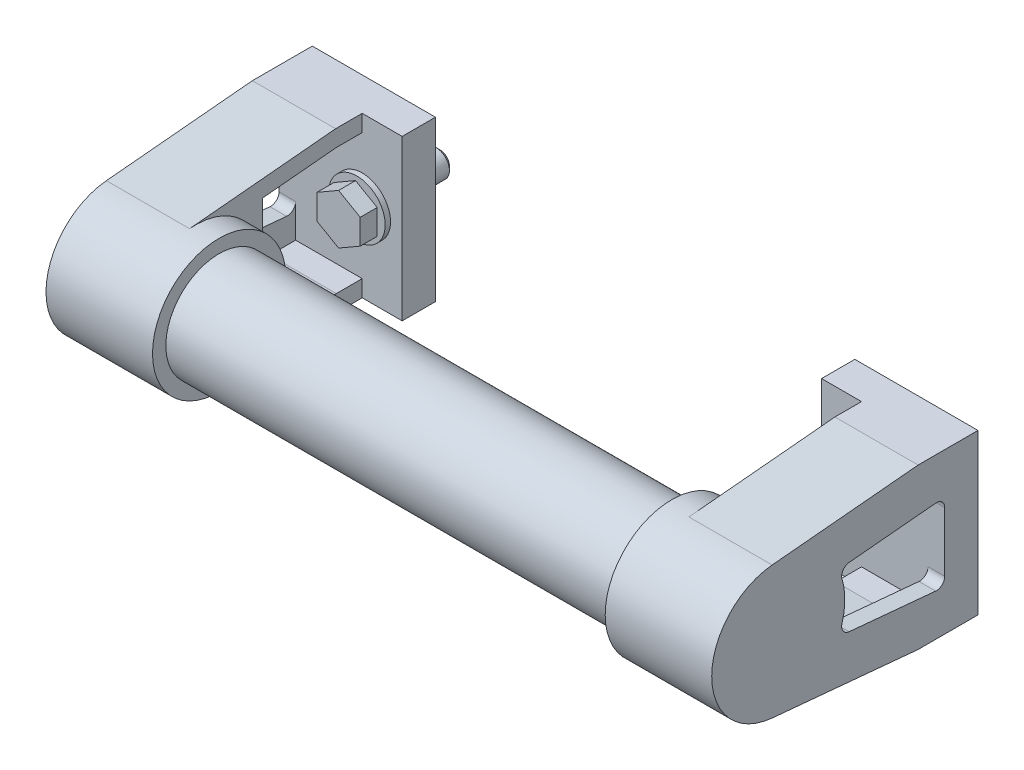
ISO-10303-21;
HEADER;
FILE_DESCRIPTION(('STEP AP214'),'2;1');
FILE_NAME('part.step','',(''),(''),'','','');
FILE_SCHEMA(('AUTOMOTIVE_DESIGN { 1 0 10303 214 1 1 1 1 }'));
ENDSEC;
DATA;
#1=APPLICATION_CONTEXT('core data for automotive mechanical design processes');
#2=APPLICATION_PROTOCOL_DEFINITION('international standard','automotive_design',2000,#1);
#3=PRODUCT_CONTEXT('',#1,'mechanical');
#4=PRODUCT('Part','Part','',(#3));
#5=PRODUCT_RELATED_PRODUCT_CATEGORY('part','',(#4));
#6=PRODUCT_DEFINITION_FORMATION('','',#4);
#7=PRODUCT_DEFINITION_CONTEXT('part definition',#1,'design');
#8=PRODUCT_DEFINITION('design','',#6,#7);
#9=PRODUCT_DEFINITION_SHAPE('','',#8);
#10=(LENGTH_UNIT() NAMED_UNIT(*) SI_UNIT(.MILLI.,.METRE.));
#11=(NAMED_UNIT(*) PLANE_ANGLE_UNIT() SI_UNIT($,.RADIAN.));
#12=(NAMED_UNIT(*) SI_UNIT($,.STERADIAN.) SOLID_ANGLE_UNIT());
#13=UNCERTAINTY_MEASURE_WITH_UNIT(LENGTH_MEASURE(1.E-05),#10,'distance_accuracy_value','');
#14=(GEOMETRIC_REPRESENTATION_CONTEXT(3) GLOBAL_UNCERTAINTY_ASSIGNED_CONTEXT((#13)) GLOBAL_UNIT_ASSIGNED_CONTEXT((#10,
#11,#12)) REPRESENTATION_CONTEXT('',''));
#15=CARTESIAN_POINT('',(0.,0.,0.));
#16=DIRECTION('',(0.,0.,1.));
#17=DIRECTION('',(1.,0.,0.));
#18=AXIS2_PLACEMENT_3D('',#15,#16,#17);
#19=CARTESIAN_POINT('',(143.,2.62637134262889E-12,60.));
#20=DIRECTION('',(-1.,0.,0.));
#21=DIRECTION('',(0.,0.,1.));
#22=AXIS2_PLACEMENT_3D('',#19,#20,#21);
#23=CYLINDRICAL_SURFACE('',#22,16.);
#24=CARTESIAN_POINT('',(143.,2.62637134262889E-12,60.));
#25=DIRECTION('',(1.,0.,0.));
#26=DIRECTION('',(0.,0.,-1.));
#27=AXIS2_PLACEMENT_3D('',#24,#25,#26);
#28=CIRCLE('',#27,16.);
#29=CARTESIAN_POINT('',(143.,2.62637134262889E-12,44.));
#30=VERTEX_POINT('',#29);
#31=EDGE_CURVE('E9',#30,#30,#28,.T.);
#32=ORIENTED_EDGE('',*,*,#31,.F.);
#33=EDGE_LOOP('',(#32));
#34=FACE_BOUND('',#33,.T.);
#35=CARTESIAN_POINT('',(7.,2.62637134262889E-12,60.));
#36=DIRECTION('',(1.,0.,0.));
#37=DIRECTION('',(0.,0.,-1.));
#38=AXIS2_PLACEMENT_3D('',#35,#36,#37);
#39=CIRCLE('',#38,16.);
#40=CARTESIAN_POINT('',(7.,2.62637134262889E-12,44.));
#41=VERTEX_POINT('',#40);
#42=EDGE_CURVE('E24',#41,#41,#39,.T.);
#43=ORIENTED_EDGE('',*,*,#42,.T.);
#44=EDGE_LOOP('',(#43));
#45=FACE_BOUND('',#44,.T.);
#46=ADVANCED_FACE('F14',(#34,#45),#23,.T.);
#47=CARTESIAN_POINT('',(0.,7.21644966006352E-13,17.1));
#48=DIRECTION('',(0.,0.,1.));
#49=DIRECTION('',(0.,-1.,0.));
#50=AXIS2_PLACEMENT_3D('',#47,#48,#49);
#51=PLANE('',#50);
#52=DIRECTION('',(-0.866025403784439,0.5,0.));
#53=VECTOR('',#52,1.);
#54=CARTESIAN_POINT('',(6.5,3.75277674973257,17.1));
#55=LINE('',#54,#53);
#56=CARTESIAN_POINT('',(6.5,3.75277674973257,17.1));
#57=VERTEX_POINT('',#56);
#58=CARTESIAN_POINT('',(0.,7.50555349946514,17.1));
#59=VERTEX_POINT('',#58);
#60=EDGE_CURVE('E905',#57,#59,#55,.T.);
#61=ORIENTED_EDGE('',*,*,#60,.T.);
#62=DIRECTION('',(-0.866025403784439,-0.5,0.));
#63=VECTOR('',#62,1.);
#64=CARTESIAN_POINT('',(0.,7.50555349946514,17.1));
#65=LINE('',#64,#63);
#66=CARTESIAN_POINT('',(-6.5,3.75277674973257,17.1));
#67=VERTEX_POINT('',#66);
#68=EDGE_CURVE('E908',#59,#67,#65,.T.);
#69=ORIENTED_EDGE('',*,*,#68,.T.);
#70=DIRECTION('',(0.,-1.,0.));
#71=VECTOR('',#70,1.);
#72=CARTESIAN_POINT('',(-6.5,3.75277674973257,17.1));
#73=LINE('',#72,#71);
#74=CARTESIAN_POINT('',(-6.5,-3.75277674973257,17.1));
#75=VERTEX_POINT('',#74);
#76=EDGE_CURVE('E911',#67,#75,#73,.T.);
#77=ORIENTED_EDGE('',*,*,#76,.T.);
#78=DIRECTION('',(0.866025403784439,-0.5,0.));
#79=VECTOR('',#78,1.);
#80=CARTESIAN_POINT('',(-6.5,-3.75277674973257,17.1));
#81=LINE('',#80,#79);
#82=CARTESIAN_POINT('',(0.,-7.50555349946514,17.1));
#83=VERTEX_POINT('',#82);
#84=EDGE_CURVE('E914',#75,#83,#81,.T.);
#85=ORIENTED_EDGE('',*,*,#84,.T.);
#86=DIRECTION('',(0.866025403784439,0.5,0.));
#87=VECTOR('',#86,1.);
#88=CARTESIAN_POINT('',(0.,-7.50555349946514,17.1));
#89=LINE('',#88,#87);
#90=CARTESIAN_POINT('',(6.5,-3.75277674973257,17.1));
#91=VERTEX_POINT('',#90);
#92=EDGE_CURVE('E917',#83,#91,#89,.T.);
#93=ORIENTED_EDGE('',*,*,#92,.T.);
#94=DIRECTION('',(0.,1.,0.));
#95=VECTOR('',#94,1.);
#96=CARTESIAN_POINT('',(6.5,-3.75277674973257,17.1));
#97=LINE('',#96,#95);
#98=EDGE_CURVE('E893',#91,#57,#97,.T.);
#99=ORIENTED_EDGE('',*,*,#98,.T.);
#100=EDGE_LOOP('',(#61,#69,#77,#85,#93,#99));
#101=FACE_BOUND('',#100,.T.);
#102=ADVANCED_FACE('F1103',(#101),#51,.T.);
#103=CARTESIAN_POINT('',(6.5,-3.75277674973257,12.));
#104=DIRECTION('',(1.,0.,0.));
#105=DIRECTION('',(0.,0.,-1.));
#106=AXIS2_PLACEMENT_3D('',#103,#104,#105);
#107=PLANE('',#106);
#108=DIRECTION('',(0.,1.,0.));
#109=VECTOR('',#108,1.);
#110=CARTESIAN_POINT('',(6.5,-3.75277674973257,12.));
#111=LINE('',#110,#109);
#112=CARTESIAN_POINT('',(6.5,-3.75277674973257,12.));
#113=VERTEX_POINT('',#112);
#114=CARTESIAN_POINT('',(6.5,3.75277674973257,12.));
#115=VERTEX_POINT('',#114);
#116=EDGE_CURVE('E902',#113,#115,#111,.T.);
#117=ORIENTED_EDGE('',*,*,#116,.T.);
#118=DIRECTION('',(0.,0.,1.));
#119=VECTOR('',#118,1.);
#120=CARTESIAN_POINT('',(6.5,3.75277674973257,12.));
#121=LINE('',#120,#119);
#122=EDGE_CURVE('E529',#115,#57,#121,.T.);
#123=ORIENTED_EDGE('',*,*,#122,.T.);
#124=ORIENTED_EDGE('',*,*,#98,.F.);
#125=DIRECTION('',(0.,0.,1.));
#126=VECTOR('',#125,1.);
#127=CARTESIAN_POINT('',(6.5,-3.75277674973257,12.));
#128=LINE('',#127,#126);
#129=EDGE_CURVE('E923',#113,#91,#128,.T.);
#130=ORIENTED_EDGE('',*,*,#129,.F.);
#131=EDGE_LOOP('',(#117,#123,#124,#130));
#132=FACE_BOUND('',#131,.T.);
#133=ADVANCED_FACE('F1110',(#132),#107,.T.);
#134=CARTESIAN_POINT('',(6.5,3.75277674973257,12.));
#135=DIRECTION('',(0.5,0.866025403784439,0.));
#136=DIRECTION('',(-0.866025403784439,0.5,0.));
#137=AXIS2_PLACEMENT_3D('',#134,#135,#136);
#138=PLANE('',#137);
#139=ORIENTED_EDGE('',*,*,#60,.F.);
#140=ORIENTED_EDGE('',*,*,#122,.F.);
#141=DIRECTION('',(-0.866025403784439,0.5,0.));
#142=VECTOR('',#141,1.);
#143=CARTESIAN_POINT('',(6.5,3.75277674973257,12.));
#144=LINE('',#143,#142);
#145=CARTESIAN_POINT('',(0.,7.50555349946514,12.));
#146=VERTEX_POINT('',#145);
#147=EDGE_CURVE('E889',#115,#146,#144,.T.);
#148=ORIENTED_EDGE('',*,*,#147,.T.);
#149=DIRECTION('',(0.,0.,1.));
#150=VECTOR('',#149,1.);
#151=CARTESIAN_POINT('',(0.,7.50555349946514,12.));
#152=LINE('',#151,#150);
#153=EDGE_CURVE('E904',#146,#59,#152,.T.);
#154=ORIENTED_EDGE('',*,*,#153,.T.);
#155=EDGE_LOOP('',(#139,#140,#148,#154));
#156=FACE_BOUND('',#155,.T.);
#157=ADVANCED_FACE('F1278',(#156),#138,.T.);
#158=CARTESIAN_POINT('',(0.,7.50555349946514,12.));
#159=DIRECTION('',(-0.5,0.866025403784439,0.));
#160=DIRECTION('',(-0.866025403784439,-0.5,0.));
#161=AXIS2_PLACEMENT_3D('',#158,#159,#160);
#162=PLANE('',#161);
#163=ORIENTED_EDGE('',*,*,#68,.F.);
#164=ORIENTED_EDGE('',*,*,#153,.F.);
#165=DIRECTION('',(-0.866025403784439,-0.5,0.));
#166=VECTOR('',#165,1.);
#167=CARTESIAN_POINT('',(0.,7.50555349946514,12.));
#168=LINE('',#167,#166);
#169=CARTESIAN_POINT('',(-6.5,3.75277674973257,12.));
#170=VERTEX_POINT('',#169);
#171=EDGE_CURVE('E892',#146,#170,#168,.T.);
#172=ORIENTED_EDGE('',*,*,#171,.T.);
#173=DIRECTION('',(0.,0.,1.));
#174=VECTOR('',#173,1.);
#175=CARTESIAN_POINT('',(-6.5,3.75277674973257,12.));
#176=LINE('',#175,#174);
#177=EDGE_CURVE('E929',#170,#67,#176,.T.);
#178=ORIENTED_EDGE('',*,*,#177,.T.);
#179=EDGE_LOOP('',(#163,#164,#172,#178));
#180=FACE_BOUND('',#179,.T.);
#181=ADVANCED_FACE('F1113',(#180),#162,.T.);
#182=CARTESIAN_POINT('',(-6.5,3.75277674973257,12.));
#183=DIRECTION('',(-1.,0.,0.));
#184=DIRECTION('',(0.,0.,1.));
#185=AXIS2_PLACEMENT_3D('',#182,#183,#184);
#186=PLANE('',#185);
#187=DIRECTION('',(0.,-1.,0.));
#188=VECTOR('',#187,1.);
#189=CARTESIAN_POINT('',(-6.5,3.75277674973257,12.));
#190=LINE('',#189,#188);
#191=CARTESIAN_POINT('',(-6.5,-3.75277674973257,12.));
#192=VERTEX_POINT('',#191);
#193=EDGE_CURVE('E896',#170,#192,#190,.T.);
#194=ORIENTED_EDGE('',*,*,#193,.T.);
#195=DIRECTION('',(0.,0.,1.));
#196=VECTOR('',#195,1.);
#197=CARTESIAN_POINT('',(-6.5,-3.75277674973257,12.));
#198=LINE('',#197,#196);
#199=EDGE_CURVE('E927',#192,#75,#198,.T.);
#200=ORIENTED_EDGE('',*,*,#199,.T.);
#201=ORIENTED_EDGE('',*,*,#76,.F.);
#202=ORIENTED_EDGE('',*,*,#177,.F.);
#203=EDGE_LOOP('',(#194,#200,#201,#202));
#204=FACE_BOUND('',#203,.T.);
#205=ADVANCED_FACE('F1288',(#204),#186,.T.);
#206=CARTESIAN_POINT('',(-6.5,-3.75277674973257,12.));
#207=DIRECTION('',(-0.5,-0.866025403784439,0.));
#208=DIRECTION('',(0.866025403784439,-0.5,0.));
#209=AXIS2_PLACEMENT_3D('',#206,#207,#208);
#210=PLANE('',#209);
#211=DIRECTION('',(0.866025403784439,-0.5,0.));
#212=VECTOR('',#211,1.);
#213=CARTESIAN_POINT('',(-6.5,-3.75277674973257,12.));
#214=LINE('',#213,#212);
#215=CARTESIAN_POINT('',(0.,-7.50555349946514,12.));
#216=VERTEX_POINT('',#215);
#217=EDGE_CURVE('E898',#192,#216,#214,.T.);
#218=ORIENTED_EDGE('',*,*,#217,.T.);
#219=DIRECTION('',(0.,0.,1.));
#220=VECTOR('',#219,1.);
#221=CARTESIAN_POINT('',(0.,-7.50555349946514,12.));
#222=LINE('',#221,#220);
#223=EDGE_CURVE('E925',#216,#83,#222,.T.);
#224=ORIENTED_EDGE('',*,*,#223,.T.);
#225=ORIENTED_EDGE('',*,*,#84,.F.);
#226=ORIENTED_EDGE('',*,*,#199,.F.);
#227=EDGE_LOOP('',(#218,#224,#225,#226));
#228=FACE_BOUND('',#227,.T.);
#229=ADVANCED_FACE('F1284',(#228),#210,.T.);
#230=CARTESIAN_POINT('',(0.,-7.50555349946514,12.));
#231=DIRECTION('',(0.5,-0.866025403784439,0.));
#232=DIRECTION('',(0.866025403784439,0.5,0.));
#233=AXIS2_PLACEMENT_3D('',#230,#231,#232);
#234=PLANE('',#233);
#235=DIRECTION('',(0.866025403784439,0.5,0.));
#236=VECTOR('',#235,1.);
#237=CARTESIAN_POINT('',(0.,-7.50555349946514,12.));
#238=LINE('',#237,#236);
#239=EDGE_CURVE('E900',#216,#113,#238,.T.);
#240=ORIENTED_EDGE('',*,*,#239,.T.);
#241=ORIENTED_EDGE('',*,*,#129,.T.);
#242=ORIENTED_EDGE('',*,*,#92,.F.);
#243=ORIENTED_EDGE('',*,*,#223,.F.);
#244=EDGE_LOOP('',(#240,#241,#242,#243));
#245=FACE_BOUND('',#244,.T.);
#246=ADVANCED_FACE('F1280',(#245),#234,.T.);
#247=CARTESIAN_POINT('',(-6.5,4.9960036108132E-13,12.));
#248=DIRECTION('',(0.,0.,-1.));
#249=DIRECTION('',(0.,1.,0.));
#250=AXIS2_PLACEMENT_3D('',#247,#248,#249);
#251=PLANE('',#250);
#252=CARTESIAN_POINT('',(0.,4.99600361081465E-13,12.));
#253=DIRECTION('',(0.,0.,1.));
#254=DIRECTION('',(0.,-1.,0.));
#255=AXIS2_PLACEMENT_3D('',#252,#253,#254);
#256=CIRCLE('',#255,5.85000000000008);
#257=CARTESIAN_POINT('',(0.,-5.84999999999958,12.0000000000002));
#258=VERTEX_POINT('',#257);
#259=EDGE_CURVE('E527',#258,#258,#256,.F.);
#260=ORIENTED_EDGE('',*,*,#259,.F.);
#261=EDGE_LOOP('',(#260));
#262=FACE_BOUND('',#261,.T.);
#263=ORIENTED_EDGE('',*,*,#239,.F.);
#264=ORIENTED_EDGE('',*,*,#217,.F.);
#265=ORIENTED_EDGE('',*,*,#193,.F.);
#266=ORIENTED_EDGE('',*,*,#171,.F.);
#267=ORIENTED_EDGE('',*,*,#147,.F.);
#268=ORIENTED_EDGE('',*,*,#116,.F.);
#269=EDGE_LOOP('',(#263,#264,#265,#266,#267,#268));
#270=FACE_BOUND('',#269,.T.);
#271=ADVANCED_FACE('F1283',(#262,#270),#251,.T.);
#272=CARTESIAN_POINT('',(0.,-5.55111512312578E-13,-13.4));
#273=DIRECTION('',(0.,0.,1.));
#274=DIRECTION('',(0.,-1.,0.));
#275=AXIS2_PLACEMENT_3D('',#272,#273,#274);
#276=PLANE('',#275);
#277=CARTESIAN_POINT('',(0.,-5.6060437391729E-13,-13.4));
#278=DIRECTION('',(0.,0.,1.));
#279=DIRECTION('',(0.,-1.,0.));
#280=AXIS2_PLACEMENT_3D('',#277,#278,#279);
#281=CIRCLE('',#280,2.79999999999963);
#282=CARTESIAN_POINT('',(0.,-2.80000000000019,-13.3999999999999));
#283=VERTEX_POINT('',#282);
#284=EDGE_CURVE('E18',#283,#283,#281,.F.);
#285=ORIENTED_EDGE('',*,*,#284,.T.);
#286=EDGE_LOOP('',(#285));
#287=FACE_BOUND('',#286,.T.);
#288=ADVANCED_FACE('F1112',(#287),#276,.F.);
#289=CARTESIAN_POINT('',(0.,3.33066907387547E-12,80.));
#290=DIRECTION('',(0.,0.,1.));
#291=DIRECTION('',(0.,-1.,0.));
#292=AXIS2_PLACEMENT_3D('',#289,#290,#291);
#293=CYLINDRICAL_SURFACE('',#292,5.85000000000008);
#294=ORIENTED_EDGE('',*,*,#259,.T.);
#295=EDGE_LOOP('',(#294));
#296=FACE_BOUND('',#295,.T.);
#297=CARTESIAN_POINT('',(0.,4.82947015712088E-13,11.6));
#298=DIRECTION('',(0.,0.,1.));
#299=DIRECTION('',(0.,-1.,0.));
#300=AXIS2_PLACEMENT_3D('',#297,#298,#299);
#301=CIRCLE('',#300,5.85000000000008);
#302=CARTESIAN_POINT('',(0.,-5.8499999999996,11.6000000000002));
#303=VERTEX_POINT('',#302);
#304=EDGE_CURVE('E524',#303,#303,#301,.F.);
#305=ORIENTED_EDGE('',*,*,#304,.F.);
#306=EDGE_LOOP('',(#305));
#307=FACE_BOUND('',#306,.T.);
#308=ADVANCED_FACE('F1884',(#296,#307),#293,.T.);
#309=CARTESIAN_POINT('',(0.,-5.10644337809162E-13,-12.2));
#310=DIRECTION('',(0.,0.,1.));
#311=DIRECTION('',(0.,-1.,0.));
#312=AXIS2_PLACEMENT_3D('',#309,#310,#311);
#313=CONICAL_SURFACE('',#312,3.99999999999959,0.785398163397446);
#314=ORIENTED_EDGE('',*,*,#284,.F.);
#315=EDGE_LOOP('',(#314));
#316=FACE_BOUND('',#315,.T.);
#317=CARTESIAN_POINT('',(0.,-5.10644337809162E-13,-12.2));
#318=DIRECTION('',(0.,0.,1.));
#319=DIRECTION('',(0.,-1.,0.));
#320=AXIS2_PLACEMENT_3D('',#317,#318,#319);
#321=CIRCLE('',#320,3.99999999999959);
#322=CARTESIAN_POINT('',(0.,-4.0000000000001,-12.1999999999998));
#323=VERTEX_POINT('',#322);
#324=EDGE_CURVE('E482',#323,#323,#321,.T.);
#325=ORIENTED_EDGE('',*,*,#324,.F.);
#326=EDGE_LOOP('',(#325));
#327=FACE_BOUND('',#326,.T.);
#328=ADVANCED_FACE('F16',(#316,#327),#313,.T.);
#329=CARTESIAN_POINT('',(-5.85,4.71844785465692E-13,11.6));
#330=DIRECTION('',(0.,0.,1.));
#331=DIRECTION('',(0.,-1.,0.));
#332=AXIS2_PLACEMENT_3D('',#329,#330,#331);
#333=PLANE('',#332);
#334=CARTESIAN_POINT('',(0.,4.82947015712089E-13,11.6));
#335=DIRECTION('',(0.,0.,1.));
#336=DIRECTION('',(0.,-1.,0.));
#337=AXIS2_PLACEMENT_3D('',#334,#335,#336);
#338=CIRCLE('',#337,8.50000000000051);
#339=CARTESIAN_POINT('',(0.,-8.50000000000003,11.6000000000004));
#340=VERTEX_POINT('',#339);
#341=EDGE_CURVE('E459',#340,#340,#338,.F.);
#342=ORIENTED_EDGE('',*,*,#341,.F.);
#343=EDGE_LOOP('',(#342));
#344=FACE_BOUND('',#343,.T.);
#345=ORIENTED_EDGE('',*,*,#304,.T.);
#346=EDGE_LOOP('',(#345));
#347=FACE_BOUND('',#346,.T.);
#348=ADVANCED_FACE('F1875',(#344,#347),#333,.T.);
#349=CARTESIAN_POINT('',(0.,5.27355936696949E-13,12.7319341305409));
#350=DIRECTION('',(0.,0.,1.));
#351=DIRECTION('',(0.,-1.,0.));
#352=AXIS2_PLACEMENT_3D('',#349,#350,#351);
#353=CYLINDRICAL_SURFACE('',#352,3.99999999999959);
#354=ORIENTED_EDGE('',*,*,#324,.T.);
#355=EDGE_LOOP('',(#354));
#356=FACE_BOUND('',#355,.T.);
#357=CARTESIAN_POINT('',(0.,0.,0.));
#358=DIRECTION('',(0.,0.,1.));
#359=DIRECTION('',(0.,-1.,0.));
#360=AXIS2_PLACEMENT_3D('',#357,#358,#359);
#361=CIRCLE('',#360,3.99999999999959);
#362=CARTESIAN_POINT('',(0.,-3.99999999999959,1.1102230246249E-13));
#363=VERTEX_POINT('',#362);
#364=EDGE_CURVE('E347',#363,#363,#361,.T.);
#365=ORIENTED_EDGE('',*,*,#364,.F.);
#366=EDGE_LOOP('',(#365));
#367=FACE_BOUND('',#366,.T.);
#368=ADVANCED_FACE('F1867',(#356,#367),#353,.T.);
#369=CARTESIAN_POINT('',(0.,3.33066907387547E-12,80.));
#370=DIRECTION('',(0.,0.,1.));
#371=DIRECTION('',(0.,-1.,0.));
#372=AXIS2_PLACEMENT_3D('',#369,#370,#371);
#373=CYLINDRICAL_SURFACE('',#372,8.50000000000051);
#374=ORIENTED_EDGE('',*,*,#341,.T.);
#375=EDGE_LOOP('',(#374));
#376=FACE_BOUND('',#375,.T.);
#377=CARTESIAN_POINT('',(0.,4.16333634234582E-13,10.));
#378=DIRECTION('',(0.,0.,1.));
#379=DIRECTION('',(0.,-1.,0.));
#380=AXIS2_PLACEMENT_3D('',#377,#378,#379);
#381=CIRCLE('',#380,8.50000000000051);
#382=CARTESIAN_POINT('',(0.,-8.50000000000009,10.0000000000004));
#383=VERTEX_POINT('',#382);
#384=EDGE_CURVE('E363',#383,#383,#381,.T.);
#385=ORIENTED_EDGE('',*,*,#384,.T.);
#386=EDGE_LOOP('',(#385));
#387=FACE_BOUND('',#386,.T.);
#388=ADVANCED_FACE('F1855',(#376,#387),#373,.T.);
#389=CARTESIAN_POINT('',(-20.,-18.9999999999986,40.0000000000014));
#390=DIRECTION('',(1.,0.,0.));
#391=DIRECTION('',(0.,0.,-1.));
#392=AXIS2_PLACEMENT_3D('',#389,#390,#391);
#393=PLANE('',#392);
#394=DIRECTION('',(0.,1.,0.));
#395=VECTOR('',#394,1.);
#396=CARTESIAN_POINT('',(-20.,-8.94532766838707,10.0000000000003));
#397=LINE('',#396,#395);
#398=CARTESIAN_POINT('',(-20.,8.94532766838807,9.99999999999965));
#399=VERTEX_POINT('',#398);
#400=CARTESIAN_POINT('',(-20.,19.0000000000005,9.99999999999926));
#401=VERTEX_POINT('',#400);
#402=EDGE_CURVE('E375',#399,#401,#397,.T.);
#403=ORIENTED_EDGE('',*,*,#402,.T.);
#404=DIRECTION('',(0.,0.,-1.));
#405=VECTOR('',#404,1.);
#406=CARTESIAN_POINT('',(-20.,19.0000000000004,9.99999999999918));
#407=LINE('',#406,#405);
#408=CARTESIAN_POINT('',(-20.,19.0000000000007,17.7675646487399));
#409=VERTEX_POINT('',#408);
#410=EDGE_CURVE('E386',#409,#401,#407,.T.);
#411=ORIENTED_EDGE('',*,*,#410,.F.);
#412=DIRECTION('',(0.,0.0927736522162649,-0.995687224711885));
#413=VECTOR('',#412,1.);
#414=CARTESIAN_POINT('',(-20.,19.0000000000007,17.7675646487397));
#415=LINE('',#414,#413);
#416=CARTESIAN_POINT('',(-20.,16.9284817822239,40.));
#417=VERTEX_POINT('',#416);
#418=EDGE_CURVE('E387',#417,#409,#415,.T.);
#419=ORIENTED_EDGE('',*,*,#418,.F.);
#420=DIRECTION('',(0.,1.,0.));
#421=VECTOR('',#420,1.);
#422=CARTESIAN_POINT('',(-20.,-23.9999999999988,40.0000000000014));
#423=LINE('',#422,#421);
#424=CARTESIAN_POINT('',(-20.,8.50076165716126,40.));
#425=VERTEX_POINT('',#424);
#426=EDGE_CURVE('E398',#425,#417,#423,.T.);
#427=ORIENTED_EDGE('',*,*,#426,.F.);
#428=CARTESIAN_POINT('',(-20.,6.52582549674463,38.4671506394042));
#429=DIRECTION('',(-1.,0.,0.));
#430=DIRECTION('',(0.,0.,1.));
#431=AXIS2_PLACEMENT_3D('',#428,#429,#430);
#432=CIRCLE('',#431,2.5);
#433=CARTESIAN_POINT('',(-20.,9.01504355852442,38.699084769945));
#434=VERTEX_POINT('',#433);
#435=EDGE_CURVE('E299',#425,#434,#432,.T.);
#436=ORIENTED_EDGE('',*,*,#435,.T.);
#437=DIRECTION('',(0.,-0.0927736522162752,0.995687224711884));
#438=VECTOR('',#437,1.);
#439=CARTESIAN_POINT('',(-20.,11.4345457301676,12.7319341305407));
#440=LINE('',#439,#438);
#441=CARTESIAN_POINT('',(-20.,11.4345457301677,12.7319341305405));
#442=VERTEX_POINT('',#441);
#443=EDGE_CURVE('E293',#434,#442,#440,.F.);
#444=ORIENTED_EDGE('',*,*,#443,.T.);
#445=CARTESIAN_POINT('',(-20.,8.94532766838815,12.4999999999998));
#446=DIRECTION('',(-1.,0.,0.));
#447=DIRECTION('',(0.,0.,1.));
#448=AXIS2_PLACEMENT_3D('',#445,#446,#447);
#449=CIRCLE('',#448,2.5);
#450=EDGE_CURVE('E296',#442,#399,#449,.T.);
#451=ORIENTED_EDGE('',*,*,#450,.T.);
#452=EDGE_LOOP('',(#403,#411,#419,#427,#436,#444,#451));
#453=FACE_BOUND('',#452,.T.);
#454=ADVANCED_FACE('F295',(#453),#393,.T.);
#455=CARTESIAN_POINT('',(-20.,-18.9999999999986,40.0000000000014));
#456=DIRECTION('',(1.,0.,0.));
#457=DIRECTION('',(0.,0.,-1.));
#458=AXIS2_PLACEMENT_3D('',#455,#456,#457);
#459=PLANE('',#458);
#460=DIRECTION('',(0.,1.,0.));
#461=VECTOR('',#460,1.);
#462=CARTESIAN_POINT('',(-20.,-23.9999999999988,40.0000000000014));
#463=LINE('',#462,#461);
#464=CARTESIAN_POINT('',(-20.,-16.9284817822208,40.0000000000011));
#465=VERTEX_POINT('',#464);
#466=CARTESIAN_POINT('',(-20.,-8.50076165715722,40.0000000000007));
#467=VERTEX_POINT('',#466);
#468=EDGE_CURVE('E423',#465,#467,#463,.T.);
#469=ORIENTED_EDGE('',*,*,#468,.F.);
#470=DIRECTION('',(0.,-0.0927736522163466,-0.995687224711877));
#471=VECTOR('',#470,1.);
#472=CARTESIAN_POINT('',(-20.,-18.9999999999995,17.7675646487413));
#473=LINE('',#472,#471);
#474=CARTESIAN_POINT('',(-20.,-18.9999999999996,17.7675646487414));
#475=VERTEX_POINT('',#474);
#476=EDGE_CURVE('E434',#465,#475,#473,.T.);
#477=ORIENTED_EDGE('',*,*,#476,.T.);
#478=DIRECTION('',(0.,0.,-1.));
#479=VECTOR('',#478,1.);
#480=CARTESIAN_POINT('',(-20.,-19.,10.0000000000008));
#481=LINE('',#480,#479);
#482=CARTESIAN_POINT('',(-20.,-19.,10.0000000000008));
#483=VERTEX_POINT('',#482);
#484=EDGE_CURVE('E457',#475,#483,#481,.T.);
#485=ORIENTED_EDGE('',*,*,#484,.T.);
#486=DIRECTION('',(0.,1.,0.));
#487=VECTOR('',#486,1.);
#488=CARTESIAN_POINT('',(-20.,-8.94532766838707,10.0000000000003));
#489=LINE('',#488,#487);
#490=CARTESIAN_POINT('',(-20.,-8.94532766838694,10.0000000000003));
#491=VERTEX_POINT('',#490);
#492=EDGE_CURVE('E443',#483,#491,#489,.T.);
#493=ORIENTED_EDGE('',*,*,#492,.T.);
#494=CARTESIAN_POINT('',(-20.,-8.94532766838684,12.5000000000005));
#495=DIRECTION('',(-1.,0.,0.));
#496=DIRECTION('',(0.,0.,1.));
#497=AXIS2_PLACEMENT_3D('',#494,#495,#496);
#498=CIRCLE('',#497,2.5);
#499=CARTESIAN_POINT('',(-20.,-11.4345457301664,12.7319341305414));
#500=VERTEX_POINT('',#499);
#501=EDGE_CURVE('E465',#491,#500,#498,.T.);
#502=ORIENTED_EDGE('',*,*,#501,.T.);
#503=DIRECTION('',(0.,0.0927736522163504,0.995687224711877));
#504=VECTOR('',#503,1.);
#505=CARTESIAN_POINT('',(-20.,-11.4345457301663,12.7319341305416));
#506=LINE('',#505,#504);
#507=CARTESIAN_POINT('',(-20.,-9.01504355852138,38.6990847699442));
#508=VERTEX_POINT('',#507);
#509=EDGE_CURVE('E462',#508,#500,#506,.F.);
#510=ORIENTED_EDGE('',*,*,#509,.F.);
#511=CARTESIAN_POINT('',(-20.,-6.52582549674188,38.4671506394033));
#512=DIRECTION('',(-1.,0.,0.));
#513=DIRECTION('',(0.,0.,1.));
#514=AXIS2_PLACEMENT_3D('',#511,#512,#513);
#515=CIRCLE('',#514,2.5);
#516=EDGE_CURVE('E419',#508,#467,#515,.T.);
#517=ORIENTED_EDGE('',*,*,#516,.T.);
#518=EDGE_LOOP('',(#469,#477,#485,#493,#502,#510,#517));
#519=FACE_BOUND('',#518,.T.);
#520=ADVANCED_FACE('F1008',(#519),#459,.T.);
#521=CARTESIAN_POINT('',(12.,-24.,10.0000000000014));
#522=DIRECTION('',(1.,0.,0.));
#523=DIRECTION('',(0.,0.,-1.));
#524=AXIS2_PLACEMENT_3D('',#521,#522,#523);
#525=PLANE('',#524);
#526=DIRECTION('',(0.,1.,0.));
#527=VECTOR('',#526,1.);
#528=CARTESIAN_POINT('',(12.,-24.0000000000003,9.43689570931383E-13));
#529=LINE('',#528,#527);
#530=CARTESIAN_POINT('',(12.,24.,-1.0177044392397E-12));
#531=VERTEX_POINT('',#530);
#532=CARTESIAN_POINT('',(12.,-24.0000000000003,9.43689570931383E-13));
#533=VERTEX_POINT('',#532);
#534=EDGE_CURVE('E312',#531,#533,#529,.F.);
#535=ORIENTED_EDGE('',*,*,#534,.F.);
#536=DIRECTION('',(0.,0.,1.));
#537=VECTOR('',#536,1.);
#538=CARTESIAN_POINT('',(12.,24.,-1.0547118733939E-12));
#539=LINE('',#538,#537);
#540=CARTESIAN_POINT('',(12.,24.0000000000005,9.99999999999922));
#541=VERTEX_POINT('',#540);
#542=EDGE_CURVE('E329',#541,#531,#539,.F.);
#543=ORIENTED_EDGE('',*,*,#542,.F.);
#544=DIRECTION('',(0.,1.,0.));
#545=VECTOR('',#544,1.);
#546=CARTESIAN_POINT('',(12.,-8.94532766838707,10.0000000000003));
#547=LINE('',#546,#545);
#548=CARTESIAN_POINT('',(12.,-24.,10.0000000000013));
#549=VERTEX_POINT('',#548);
#550=EDGE_CURVE('E360',#541,#549,#547,.F.);
#551=ORIENTED_EDGE('',*,*,#550,.T.);
#552=DIRECTION('',(0.,0.,1.));
#553=VECTOR('',#552,1.);
#554=CARTESIAN_POINT('',(12.,-24.0000000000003,9.43689570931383E-13));
#555=LINE('',#554,#553);
#556=EDGE_CURVE('E342',#549,#533,#555,.F.);
#557=ORIENTED_EDGE('',*,*,#556,.T.);
#558=EDGE_LOOP('',(#535,#543,#551,#557));
#559=FACE_BOUND('',#558,.T.);
#560=ADVANCED_FACE('F1049',(#559),#525,.T.);
#561=CARTESIAN_POINT('',(-11.,19.0000000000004,9.99999999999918));
#562=DIRECTION('',(0.,-1.,0.));
#563=DIRECTION('',(0.,0.,-1.));
#564=AXIS2_PLACEMENT_3D('',#561,#562,#563);
#565=PLANE('',#564);
#566=DIRECTION('',(1.,0.,0.));
#567=VECTOR('',#566,1.);
#568=CARTESIAN_POINT('',(16.,19.0000000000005,9.99999999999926));
#569=LINE('',#568,#567);
#570=CARTESIAN_POINT('',(0.,19.0000000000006,9.99999999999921));
#571=VERTEX_POINT('',#570);
#572=EDGE_CURVE('E372',#401,#571,#569,.T.);
#573=ORIENTED_EDGE('',*,*,#572,.T.);
#574=DIRECTION('',(0.,0.,-1.));
#575=VECTOR('',#574,1.);
#576=CARTESIAN_POINT('',(0.,19.0000000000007,60.));
#577=LINE('',#576,#575);
#578=CARTESIAN_POINT('',(0.,19.0000000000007,17.7675646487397));
#579=VERTEX_POINT('',#578);
#580=EDGE_CURVE('E369',#579,#571,#577,.T.);
#581=ORIENTED_EDGE('',*,*,#580,.F.);
#582=DIRECTION('',(1.,0.,0.));
#583=VECTOR('',#582,1.);
#584=CARTESIAN_POINT('',(-11.,19.0000000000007,17.7675646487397));
#585=LINE('',#584,#583);
#586=EDGE_CURVE('E383',#579,#409,#585,.F.);
#587=ORIENTED_EDGE('',*,*,#586,.T.);
#588=ORIENTED_EDGE('',*,*,#410,.T.);
#589=EDGE_LOOP('',(#573,#581,#587,#588));
#590=FACE_BOUND('',#589,.T.);
#591=ADVANCED_FACE('F1065',(#590),#565,.T.);
#592=CARTESIAN_POINT('',(-11.,19.0000000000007,17.7675646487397));
#593=DIRECTION('',(0.,-0.995687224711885,-0.0927736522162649));
#594=DIRECTION('',(0.,0.0927736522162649,-0.995687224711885));
#595=AXIS2_PLACEMENT_3D('',#592,#593,#594);
#596=PLANE('',#595);
#597=ORIENTED_EDGE('',*,*,#586,.F.);
#598=DIRECTION('',(0.,0.0927736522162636,-0.995687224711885));
#599=VECTOR('',#598,1.);
#600=CARTESIAN_POINT('',(0.,16.9284817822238,40.));
#601=LINE('',#600,#599);
#602=CARTESIAN_POINT('',(0.,16.9284817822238,40.));
#603=VERTEX_POINT('',#602);
#604=EDGE_CURVE('E380',#603,#579,#601,.T.);
#605=ORIENTED_EDGE('',*,*,#604,.F.);
#606=DIRECTION('',(1.,0.,0.));
#607=VECTOR('',#606,1.);
#608=CARTESIAN_POINT('',(-11.,16.9284817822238,40.));
#609=LINE('',#608,#607);
#610=EDGE_CURVE('E395',#603,#417,#609,.F.);
#611=ORIENTED_EDGE('',*,*,#610,.T.);
#612=ORIENTED_EDGE('',*,*,#418,.T.);
#613=EDGE_LOOP('',(#597,#605,#611,#612));
#614=FACE_BOUND('',#613,.T.);
#615=ADVANCED_FACE('F1070',(#614),#596,.T.);
#616=CARTESIAN_POINT('',(3.99999999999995,-23.9999999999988,40.0000000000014));
#617=DIRECTION('',(0.,0.,-1.));
#618=DIRECTION('',(0.,1.,0.));
#619=AXIS2_PLACEMENT_3D('',#616,#617,#618);
#620=PLANE('',#619);
#621=DIRECTION('',(-1.,0.,0.));
#622=VECTOR('',#621,1.);
#623=CARTESIAN_POINT('',(16.,8.50076165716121,40.));
#624=LINE('',#623,#622);
#625=CARTESIAN_POINT('',(0.,8.50076165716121,40.));
#626=VERTEX_POINT('',#625);
#627=EDGE_CURVE('E318',#626,#425,#624,.T.);
#628=ORIENTED_EDGE('',*,*,#627,.T.);
#629=ORIENTED_EDGE('',*,*,#426,.T.);
#630=ORIENTED_EDGE('',*,*,#610,.F.);
#631=DIRECTION('',(0.,1.,0.));
#632=VECTOR('',#631,1.);
#633=CARTESIAN_POINT('',(0.,2.62290189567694E-12,40.));
#634=LINE('',#633,#632);
#635=EDGE_CURVE('E392',#626,#603,#634,.T.);
#636=ORIENTED_EDGE('',*,*,#635,.F.);
#637=EDGE_LOOP('',(#628,#629,#630,#636));
#638=FACE_BOUND('',#637,.T.);
#639=ADVANCED_FACE('F1072',(#638),#620,.T.);
#640=CARTESIAN_POINT('',(16.,-24.0000000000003,9.43689570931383E-13));
#641=DIRECTION('',(0.,0.,-1.));
#642=DIRECTION('',(0.,1.,0.));
#643=AXIS2_PLACEMENT_3D('',#640,#641,#642);
#644=PLANE('',#643);
#645=DIRECTION('',(1.,0.,0.));
#646=VECTOR('',#645,1.);
#647=CARTESIAN_POINT('',(16.,-24.0000000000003,9.43689570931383E-13));
#648=LINE('',#647,#646);
#649=CARTESIAN_POINT('',(-25.,-24.0000000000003,-3.88578058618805E-13));
#650=VERTEX_POINT('',#649);
#651=EDGE_CURVE('E339',#533,#650,#648,.F.);
#652=ORIENTED_EDGE('',*,*,#651,.T.);
#653=DIRECTION('',(0.,1.,0.));
#654=VECTOR('',#653,1.);
#655=CARTESIAN_POINT('',(-25.,2.62290189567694E-12,-1.0547118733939E-12));
#656=LINE('',#655,#654);
#657=CARTESIAN_POINT('',(-25.,24.0000000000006,-1.0547118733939E-12));
#658=VERTEX_POINT('',#657);
#659=EDGE_CURVE('E332',#658,#650,#656,.F.);
#660=ORIENTED_EDGE('',*,*,#659,.F.);
#661=DIRECTION('',(1.,0.,0.));
#662=VECTOR('',#661,1.);
#663=CARTESIAN_POINT('',(16.,24.,-1.0547118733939E-12));
#664=LINE('',#663,#662);
#665=EDGE_CURVE('E326',#531,#658,#664,.F.);
#666=ORIENTED_EDGE('',*,*,#665,.F.);
#667=ORIENTED_EDGE('',*,*,#534,.T.);
#668=EDGE_LOOP('',(#652,#660,#666,#667));
#669=FACE_BOUND('',#668,.T.);
#670=ORIENTED_EDGE('',*,*,#364,.T.);
#671=EDGE_LOOP('',(#670));
#672=FACE_BOUND('',#671,.T.);
#673=ADVANCED_FACE('F1052',(#669,#672),#644,.T.);
#674=CARTESIAN_POINT('',(16.,24.,-1.0547118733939E-12));
#675=DIRECTION('',(0.,1.,0.));
#676=DIRECTION('',(0.,0.,1.));
#677=AXIS2_PLACEMENT_3D('',#674,#675,#676);
#678=PLANE('',#677);
#679=DIRECTION('',(0.,0.,1.));
#680=VECTOR('',#679,1.);
#681=CARTESIAN_POINT('',(-25.,24.0000000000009,60.));
#682=LINE('',#681,#680);
#683=CARTESIAN_POINT('',(-25.,24.0000000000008,17.999999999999));
#684=VERTEX_POINT('',#683);
#685=EDGE_CURVE('E336',#684,#658,#682,.F.);
#686=ORIENTED_EDGE('',*,*,#685,.F.);
#687=DIRECTION('',(1.,0.,0.));
#688=VECTOR('',#687,1.);
#689=CARTESIAN_POINT('',(16.,24.0000000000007,17.999999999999));
#690=LINE('',#689,#688);
#691=CARTESIAN_POINT('',(0.,24.0000000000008,17.999999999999));
#692=VERTEX_POINT('',#691);
#693=EDGE_CURVE('E940',#692,#684,#690,.F.);
#694=ORIENTED_EDGE('',*,*,#693,.F.);
#695=DIRECTION('',(0.,0.,1.));
#696=VECTOR('',#695,1.);
#697=CARTESIAN_POINT('',(0.,24.,-1.0547118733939E-12));
#698=LINE('',#697,#696);
#699=CARTESIAN_POINT('',(0.,24.0000000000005,9.99999999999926));
#700=VERTEX_POINT('',#699);
#701=EDGE_CURVE('E357',#692,#700,#698,.F.);
#702=ORIENTED_EDGE('',*,*,#701,.T.);
#703=DIRECTION('',(1.,0.,0.));
#704=VECTOR('',#703,1.);
#705=CARTESIAN_POINT('',(16.,24.0000000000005,9.9999999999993));
#706=LINE('',#705,#704);
#707=EDGE_CURVE('E352',#700,#541,#706,.T.);
#708=ORIENTED_EDGE('',*,*,#707,.T.);
#709=ORIENTED_EDGE('',*,*,#542,.T.);
#710=ORIENTED_EDGE('',*,*,#665,.T.);
#711=EDGE_LOOP('',(#686,#694,#702,#708,#709,#710));
#712=FACE_BOUND('',#711,.T.);
#713=ADVANCED_FACE('F1056',(#712),#678,.T.);
#714=CARTESIAN_POINT('',(16.,6.52582549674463,38.4671506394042));
#715=DIRECTION('',(-1.,0.,0.));
#716=DIRECTION('',(0.,0.,1.));
#717=AXIS2_PLACEMENT_3D('',#714,#715,#716);
#718=CYLINDRICAL_SURFACE('',#717,2.5);
#719=CARTESIAN_POINT('',(0.,6.52582549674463,38.4671506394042));
#720=DIRECTION('',(-1.,0.,0.));
#721=DIRECTION('',(0.,0.,1.));
#722=AXIS2_PLACEMENT_3D('',#719,#720,#721);
#723=CIRCLE('',#722,2.5);
#724=CARTESIAN_POINT('',(0.,5.80073377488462,40.8596894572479));
#725=VERTEX_POINT('',#724);
#726=EDGE_CURVE('E368',#725,#626,#723,.T.);
#727=ORIENTED_EDGE('',*,*,#726,.F.);
#728=DIRECTION('',(-1.,0.,0.));
#729=VECTOR('',#728,1.);
#730=CARTESIAN_POINT('',(7.,5.8007337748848,40.8596894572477));
#731=LINE('',#730,#729);
#732=CARTESIAN_POINT('',(-25.,5.80073377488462,40.8596894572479));
#733=VERTEX_POINT('',#732);
#734=EDGE_CURVE('E498',#733,#725,#731,.F.);
#735=ORIENTED_EDGE('',*,*,#734,.F.);
#736=CARTESIAN_POINT('',(-25.,6.52582549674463,38.4671506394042));
#737=DIRECTION('',(-1.,0.,0.));
#738=DIRECTION('',(0.,0.,1.));
#739=AXIS2_PLACEMENT_3D('',#736,#737,#738);
#740=CIRCLE('',#739,2.5);
#741=CARTESIAN_POINT('',(-25.,9.01504355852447,38.699084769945));
#742=VERTEX_POINT('',#741);
#743=EDGE_CURVE('E507',#742,#733,#740,.F.);
#744=ORIENTED_EDGE('',*,*,#743,.F.);
#745=DIRECTION('',(-1.,0.,0.));
#746=VECTOR('',#745,1.);
#747=CARTESIAN_POINT('',(16.,9.01504355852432,38.6990847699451));
#748=LINE('',#747,#746);
#749=EDGE_CURVE('E324',#434,#742,#748,.T.);
#750=ORIENTED_EDGE('',*,*,#749,.F.);
#751=ORIENTED_EDGE('',*,*,#435,.F.);
#752=ORIENTED_EDGE('',*,*,#627,.F.);
#753=EDGE_LOOP('',(#727,#735,#744,#750,#751,#752));
#754=FACE_BOUND('',#753,.T.);
#755=ADVANCED_FACE('F1075',(#754),#718,.F.);
#756=CARTESIAN_POINT('',(7.,11.4345457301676,12.7319341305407));
#757=DIRECTION('',(0.,0.995687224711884,0.0927736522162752));
#758=DIRECTION('',(0.,-0.0927736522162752,0.995687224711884));
#759=AXIS2_PLACEMENT_3D('',#756,#757,#758);
#760=PLANE('',#759);
#761=DIRECTION('',(0.,-0.0927736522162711,0.995687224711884));
#762=VECTOR('',#761,1.);
#763=CARTESIAN_POINT('',(-25.,11.4345457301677,12.7319341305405));
#764=LINE('',#763,#762);
#765=CARTESIAN_POINT('',(-25.,11.4345457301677,12.7319341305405));
#766=VERTEX_POINT('',#765);
#767=EDGE_CURVE('E316',#766,#742,#764,.T.);
#768=ORIENTED_EDGE('',*,*,#767,.F.);
#769=DIRECTION('',(1.,0.,0.));
#770=VECTOR('',#769,1.);
#771=CARTESIAN_POINT('',(7.,11.4345457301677,12.7319341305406));
#772=LINE('',#771,#770);
#773=EDGE_CURVE('E304',#442,#766,#772,.F.);
#774=ORIENTED_EDGE('',*,*,#773,.F.);
#775=ORIENTED_EDGE('',*,*,#443,.F.);
#776=ORIENTED_EDGE('',*,*,#749,.T.);
#777=EDGE_LOOP('',(#768,#774,#775,#776));
#778=FACE_BOUND('',#777,.T.);
#779=ADVANCED_FACE('F314',(#778),#760,.F.);
#780=CARTESIAN_POINT('',(7.,8.94532766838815,12.4999999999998));
#781=DIRECTION('',(-1.,0.,0.));
#782=DIRECTION('',(0.,0.,1.));
#783=AXIS2_PLACEMENT_3D('',#780,#781,#782);
#784=CYLINDRICAL_SURFACE('',#783,2.5);
#785=ORIENTED_EDGE('',*,*,#773,.T.);
#786=CARTESIAN_POINT('',(-25.,8.94532766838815,12.4999999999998));
#787=DIRECTION('',(-1.,0.,0.));
#788=DIRECTION('',(0.,0.,1.));
#789=AXIS2_PLACEMENT_3D('',#786,#787,#788);
#790=CIRCLE('',#789,2.5);
#791=CARTESIAN_POINT('',(-25.,8.94532766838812,10.));
#792=VERTEX_POINT('',#791);
#793=EDGE_CURVE('E335',#792,#766,#790,.F.);
#794=ORIENTED_EDGE('',*,*,#793,.F.);
#795=DIRECTION('',(1.,0.,0.));
#796=VECTOR('',#795,1.);
#797=CARTESIAN_POINT('',(16.,8.94532766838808,9.99999999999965));
#798=LINE('',#797,#796);
#799=EDGE_CURVE('E310',#792,#399,#798,.T.);
#800=ORIENTED_EDGE('',*,*,#799,.T.);
#801=ORIENTED_EDGE('',*,*,#450,.F.);
#802=EDGE_LOOP('',(#785,#794,#800,#801));
#803=FACE_BOUND('',#802,.T.);
#804=ADVANCED_FACE('F307',(#803),#784,.F.);
#805=CARTESIAN_POINT('',(7.,-8.94532766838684,12.5000000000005));
#806=DIRECTION('',(-1.,0.,0.));
#807=DIRECTION('',(0.,0.,1.));
#808=AXIS2_PLACEMENT_3D('',#805,#806,#807);
#809=CYLINDRICAL_SURFACE('',#808,2.5);
#810=CARTESIAN_POINT('',(-25.,-8.94532766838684,12.5000000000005));
#811=DIRECTION('',(-1.,0.,0.));
#812=DIRECTION('',(0.,0.,1.));
#813=AXIS2_PLACEMENT_3D('',#810,#811,#812);
#814=CIRCLE('',#813,2.5);
#815=CARTESIAN_POINT('',(-25.,-11.4345457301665,12.7319341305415));
#816=VERTEX_POINT('',#815);
#817=CARTESIAN_POINT('',(-25.,-8.94532766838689,10.0000000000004));
#818=VERTEX_POINT('',#817);
#819=EDGE_CURVE('E499',#816,#818,#814,.F.);
#820=ORIENTED_EDGE('',*,*,#819,.F.);
#821=DIRECTION('',(-1.,0.,0.));
#822=VECTOR('',#821,1.);
#823=CARTESIAN_POINT('',(7.,-11.4345457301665,12.7319341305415));
#824=LINE('',#823,#822);
#825=EDGE_CURVE('E516',#500,#816,#824,.T.);
#826=ORIENTED_EDGE('',*,*,#825,.F.);
#827=ORIENTED_EDGE('',*,*,#501,.F.);
#828=DIRECTION('',(1.,0.,0.));
#829=VECTOR('',#828,1.);
#830=CARTESIAN_POINT('',(16.,-8.94532766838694,10.0000000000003));
#831=LINE('',#830,#829);
#832=EDGE_CURVE('E454',#491,#818,#831,.F.);
#833=ORIENTED_EDGE('',*,*,#832,.T.);
#834=EDGE_LOOP('',(#820,#826,#827,#833));
#835=FACE_BOUND('',#834,.T.);
#836=ADVANCED_FACE('F1014',(#835),#809,.F.);
#837=CARTESIAN_POINT('',(7.,-11.4345457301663,12.7319341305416));
#838=DIRECTION('',(0.,0.995687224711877,-0.0927736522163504));
#839=DIRECTION('',(0.,0.0927736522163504,0.995687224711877));
#840=AXIS2_PLACEMENT_3D('',#837,#838,#839);
#841=PLANE('',#840);
#842=ORIENTED_EDGE('',*,*,#825,.T.);
#843=DIRECTION('',(0.,-0.0927736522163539,-0.995687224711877));
#844=VECTOR('',#843,1.);
#845=CARTESIAN_POINT('',(-25.,-9.01504355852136,38.6990847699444));
#846=LINE('',#845,#844);
#847=CARTESIAN_POINT('',(-25.,-9.01504355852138,38.6990847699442));
#848=VERTEX_POINT('',#847);
#849=EDGE_CURVE('E503',#848,#816,#846,.T.);
#850=ORIENTED_EDGE('',*,*,#849,.F.);
#851=DIRECTION('',(1.,0.,0.));
#852=VECTOR('',#851,1.);
#853=CARTESIAN_POINT('',(7.,-9.01504355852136,38.6990847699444));
#854=LINE('',#853,#852);
#855=EDGE_CURVE('E418',#848,#508,#854,.T.);
#856=ORIENTED_EDGE('',*,*,#855,.T.);
#857=ORIENTED_EDGE('',*,*,#509,.T.);
#858=EDGE_LOOP('',(#842,#850,#856,#857));
#859=FACE_BOUND('',#858,.T.);
#860=ADVANCED_FACE('F998',(#859),#841,.T.);
#861=CARTESIAN_POINT('',(-11.,-18.9999999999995,17.7675646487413));
#862=DIRECTION('',(0.,-0.995687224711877,0.0927736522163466));
#863=DIRECTION('',(0.,-0.0927736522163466,-0.995687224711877));
#864=AXIS2_PLACEMENT_3D('',#861,#862,#863);
#865=PLANE('',#864);
#866=ORIENTED_EDGE('',*,*,#476,.F.);
#867=DIRECTION('',(1.,0.,0.));
#868=VECTOR('',#867,1.);
#869=CARTESIAN_POINT('',(3.99999999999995,-16.9284817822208,40.0000000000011));
#870=LINE('',#869,#868);
#871=CARTESIAN_POINT('',(0.,-16.9284817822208,40.0000000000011));
#872=VERTEX_POINT('',#871);
#873=EDGE_CURVE('E420',#872,#465,#870,.F.);
#874=ORIENTED_EDGE('',*,*,#873,.F.);
#875=DIRECTION('',(0.,0.0927736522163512,0.995687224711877));
#876=VECTOR('',#875,1.);
#877=CARTESIAN_POINT('',(0.,-18.9999999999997,17.7675646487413));
#878=LINE('',#877,#876);
#879=CARTESIAN_POINT('',(0.,-19.,17.7675646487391));
#880=VERTEX_POINT('',#879);
#881=EDGE_CURVE('E427',#880,#872,#878,.T.);
#882=ORIENTED_EDGE('',*,*,#881,.F.);
#883=DIRECTION('',(1.,0.,0.));
#884=VECTOR('',#883,1.);
#885=CARTESIAN_POINT('',(-11.,-18.9999999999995,17.7675646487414));
#886=LINE('',#885,#884);
#887=EDGE_CURVE('E424',#475,#880,#886,.T.);
#888=ORIENTED_EDGE('',*,*,#887,.F.);
#889=EDGE_LOOP('',(#866,#874,#882,#888));
#890=FACE_BOUND('',#889,.T.);
#891=ADVANCED_FACE('F1038',(#890),#865,.F.);
#892=CARTESIAN_POINT('',(-11.,-19.,10.0000000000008));
#893=DIRECTION('',(0.,-1.,0.));
#894=DIRECTION('',(0.,0.,-1.));
#895=AXIS2_PLACEMENT_3D('',#892,#893,#894);
#896=PLANE('',#895);
#897=ORIENTED_EDGE('',*,*,#484,.F.);
#898=ORIENTED_EDGE('',*,*,#887,.T.);
#899=DIRECTION('',(0.,0.,-1.));
#900=VECTOR('',#899,1.);
#901=CARTESIAN_POINT('',(0.,-19.,38.4671506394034));
#902=LINE('',#901,#900);
#903=CARTESIAN_POINT('',(0.,-19.,10.0000000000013));
#904=VERTEX_POINT('',#903);
#905=EDGE_CURVE('E403',#904,#880,#902,.F.);
#906=ORIENTED_EDGE('',*,*,#905,.F.);
#907=DIRECTION('',(1.,0.,0.));
#908=VECTOR('',#907,1.);
#909=CARTESIAN_POINT('',(16.,-19.,10.0000000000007));
#910=LINE('',#909,#908);
#911=EDGE_CURVE('E362',#904,#483,#910,.F.);
#912=ORIENTED_EDGE('',*,*,#911,.T.);
#913=EDGE_LOOP('',(#897,#898,#906,#912));
#914=FACE_BOUND('',#913,.T.);
#915=ADVANCED_FACE('F1036',(#914),#896,.F.);
#916=CARTESIAN_POINT('',(16.,-8.94532766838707,10.0000000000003));
#917=DIRECTION('',(0.,0.,-1.));
#918=DIRECTION('',(0.,1.,0.));
#919=AXIS2_PLACEMENT_3D('',#916,#917,#918);
#920=PLANE('',#919);
#921=ORIENTED_EDGE('',*,*,#572,.F.);
#922=ORIENTED_EDGE('',*,*,#402,.F.);
#923=ORIENTED_EDGE('',*,*,#799,.F.);
#924=DIRECTION('',(0.,1.,0.));
#925=VECTOR('',#924,1.);
#926=CARTESIAN_POINT('',(-25.,2.62290189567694E-12,10.0000000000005));
#927=LINE('',#926,#925);
#928=EDGE_CURVE('E502',#818,#792,#927,.T.);
#929=ORIENTED_EDGE('',*,*,#928,.F.);
#930=ORIENTED_EDGE('',*,*,#832,.F.);
#931=ORIENTED_EDGE('',*,*,#492,.F.);
#932=ORIENTED_EDGE('',*,*,#911,.F.);
#933=DIRECTION('',(0.,1.,0.));
#934=VECTOR('',#933,1.);
#935=CARTESIAN_POINT('',(0.,-6.52582549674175,10.0000000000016));
#936=LINE('',#935,#934);
#937=CARTESIAN_POINT('',(0.,-24.,10.0000000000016));
#938=VERTEX_POINT('',#937);
#939=EDGE_CURVE('E374',#938,#904,#936,.T.);
#940=ORIENTED_EDGE('',*,*,#939,.F.);
#941=DIRECTION('',(1.,0.,0.));
#942=VECTOR('',#941,1.);
#943=CARTESIAN_POINT('',(16.,-24.,10.0000000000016));
#944=LINE('',#943,#942);
#945=EDGE_CURVE('E406',#938,#549,#944,.T.);
#946=ORIENTED_EDGE('',*,*,#945,.T.);
#947=ORIENTED_EDGE('',*,*,#550,.F.);
#948=ORIENTED_EDGE('',*,*,#707,.F.);
#949=DIRECTION('',(0.,1.,0.));
#950=VECTOR('',#949,1.);
#951=CARTESIAN_POINT('',(0.,2.62290189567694E-12,9.99999999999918));
#952=LINE('',#951,#950);
#953=EDGE_CURVE('E366',#571,#700,#952,.T.);
#954=ORIENTED_EDGE('',*,*,#953,.F.);
#955=EDGE_LOOP('',(#921,#922,#923,#929,#930,#931,#932,#940,#946,#947,#948,#954));
#956=FACE_BOUND('',#955,.T.);
#957=ORIENTED_EDGE('',*,*,#384,.F.);
#958=EDGE_LOOP('',(#957));
#959=FACE_BOUND('',#958,.T.);
#960=ADVANCED_FACE('F1018',(#956,#959),#920,.F.);
#961=CARTESIAN_POINT('',(16.,-6.52582549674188,38.4671506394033));
#962=DIRECTION('',(-1.,0.,0.));
#963=DIRECTION('',(0.,0.,1.));
#964=AXIS2_PLACEMENT_3D('',#961,#962,#963);
#965=CYLINDRICAL_SURFACE('',#964,2.5);
#966=CARTESIAN_POINT('',(0.,-6.52582549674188,38.4671506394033));
#967=DIRECTION('',(-1.,0.,0.));
#968=DIRECTION('',(0.,0.,1.));
#969=AXIS2_PLACEMENT_3D('',#966,#967,#968);
#970=CIRCLE('',#969,2.5);
#971=CARTESIAN_POINT('',(0.,-8.50076165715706,40.0000000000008));
#972=VERTEX_POINT('',#971);
#973=CARTESIAN_POINT('',(0.,-5.80073377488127,40.8596894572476));
#974=VERTEX_POINT('',#973);
#975=EDGE_CURVE('E412',#972,#974,#970,.T.);
#976=ORIENTED_EDGE('',*,*,#975,.F.);
#977=DIRECTION('',(-1.,0.,0.));
#978=VECTOR('',#977,1.);
#979=CARTESIAN_POINT('',(16.,-8.50076165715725,40.0000000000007));
#980=LINE('',#979,#978);
#981=EDGE_CURVE('E415',#467,#972,#980,.F.);
#982=ORIENTED_EDGE('',*,*,#981,.F.);
#983=ORIENTED_EDGE('',*,*,#516,.F.);
#984=ORIENTED_EDGE('',*,*,#855,.F.);
#985=CARTESIAN_POINT('',(-25.,-6.52582549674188,38.4671506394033));
#986=DIRECTION('',(-1.,0.,0.));
#987=DIRECTION('',(0.,0.,1.));
#988=AXIS2_PLACEMENT_3D('',#985,#986,#987);
#989=CIRCLE('',#988,2.5);
#990=CARTESIAN_POINT('',(-25.,-5.80073377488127,40.8596894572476));
#991=VERTEX_POINT('',#990);
#992=EDGE_CURVE('E504',#991,#848,#989,.F.);
#993=ORIENTED_EDGE('',*,*,#992,.F.);
#994=DIRECTION('',(-1.,0.,0.));
#995=VECTOR('',#994,1.);
#996=CARTESIAN_POINT('',(7.,-5.80073377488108,40.8596894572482));
#997=LINE('',#996,#995);
#998=EDGE_CURVE('E492',#974,#991,#997,.T.);
#999=ORIENTED_EDGE('',*,*,#998,.F.);
#1000=EDGE_LOOP('',(#976,#982,#983,#984,#993,#999));
#1001=FACE_BOUND('',#1000,.T.);
#1002=ADVANCED_FACE('F1002',(#1001),#965,.F.);
#1003=CARTESIAN_POINT('',(3.99999999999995,-23.9999999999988,40.0000000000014));
#1004=DIRECTION('',(0.,0.,-1.));
#1005=DIRECTION('',(0.,1.,0.));
#1006=AXIS2_PLACEMENT_3D('',#1003,#1004,#1005);
#1007=PLANE('',#1006);
#1008=ORIENTED_EDGE('',*,*,#873,.T.);
#1009=ORIENTED_EDGE('',*,*,#468,.T.);
#1010=ORIENTED_EDGE('',*,*,#981,.T.);
#1011=DIRECTION('',(0.,1.,0.));
#1012=VECTOR('',#1011,1.);
#1013=CARTESIAN_POINT('',(0.,-6.52582549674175,40.0000000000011));
#1014=LINE('',#1013,#1012);
#1015=EDGE_CURVE('E430',#872,#972,#1014,.T.);
#1016=ORIENTED_EDGE('',*,*,#1015,.F.);
#1017=EDGE_LOOP('',(#1008,#1009,#1010,#1016));
#1018=FACE_BOUND('',#1017,.T.);
#1019=ADVANCED_FACE('F1031',(#1018),#1007,.T.);
#1020=CARTESIAN_POINT('',(16.,-24.0000000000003,9.43689570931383E-13));
#1021=DIRECTION('',(0.,1.,0.));
#1022=DIRECTION('',(0.,0.,1.));
#1023=AXIS2_PLACEMENT_3D('',#1020,#1021,#1022);
#1024=PLANE('',#1023);
#1025=DIRECTION('',(0.,0.,1.));
#1026=VECTOR('',#1025,1.);
#1027=CARTESIAN_POINT('',(0.,-24.0000000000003,9.43689570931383E-13));
#1028=LINE('',#1027,#1026);
#1029=CARTESIAN_POINT('',(0.,-23.9999999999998,17.999999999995));
#1030=VERTEX_POINT('',#1029);
#1031=EDGE_CURVE('E341',#1030,#938,#1028,.F.);
#1032=ORIENTED_EDGE('',*,*,#1031,.F.);
#1033=DIRECTION('',(1.,0.,0.));
#1034=VECTOR('',#1033,1.);
#1035=CARTESIAN_POINT('',(16.,-24.,17.999999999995));
#1036=LINE('',#1035,#1034);
#1037=CARTESIAN_POINT('',(-25.,-24.,17.999999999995));
#1038=VERTEX_POINT('',#1037);
#1039=EDGE_CURVE('E968',#1030,#1038,#1036,.F.);
#1040=ORIENTED_EDGE('',*,*,#1039,.T.);
#1041=DIRECTION('',(0.,0.,1.));
#1042=VECTOR('',#1041,1.);
#1043=CARTESIAN_POINT('',(-25.,-24.0000000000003,60.));
#1044=LINE('',#1043,#1042);
#1045=EDGE_CURVE('E328',#650,#1038,#1044,.T.);
#1046=ORIENTED_EDGE('',*,*,#1045,.F.);
#1047=ORIENTED_EDGE('',*,*,#651,.F.);
#1048=ORIENTED_EDGE('',*,*,#556,.F.);
#1049=ORIENTED_EDGE('',*,*,#945,.F.);
#1050=EDGE_LOOP('',(#1032,#1040,#1046,#1047,#1048,#1049));
#1051=FACE_BOUND('',#1050,.T.);
#1052=ADVANCED_FACE('F1046',(#1051),#1024,.F.);
#1053=CARTESIAN_POINT('',(16.,24.0000000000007,17.999999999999));
#1054=DIRECTION('',(0.,0.995687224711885,0.092773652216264));
#1055=DIRECTION('',(0.,-0.092773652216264,0.995687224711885));
#1056=AXIS2_PLACEMENT_3D('',#1053,#1054,#1055);
#1057=PLANE('',#1056);
#1058=DIRECTION('',(1.,0.,0.));
#1059=VECTOR('',#1058,1.);
#1060=CARTESIAN_POINT('',(16.,19.9137444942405,61.8554730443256));
#1061=LINE('',#1060,#1059);
#1062=CARTESIAN_POINT('',(-25.,19.9137444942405,61.8554730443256));
#1063=VERTEX_POINT('',#1062);
#1064=CARTESIAN_POINT('',(0.,19.9137444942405,61.8554730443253));
#1065=VERTEX_POINT('',#1064);
#1066=EDGE_CURVE('E483',#1063,#1065,#1061,.T.);
#1067=ORIENTED_EDGE('',*,*,#1066,.T.);
#1068=DIRECTION('',(0.,-0.092773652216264,0.995687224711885));
#1069=VECTOR('',#1068,1.);
#1070=CARTESIAN_POINT('',(0.,24.0000000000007,17.999999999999));
#1071=LINE('',#1070,#1069);
#1072=EDGE_CURVE('E486',#1065,#692,#1071,.F.);
#1073=ORIENTED_EDGE('',*,*,#1072,.T.);
#1074=ORIENTED_EDGE('',*,*,#693,.T.);
#1075=DIRECTION('',(0.,-0.092773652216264,0.995687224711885));
#1076=VECTOR('',#1075,1.);
#1077=CARTESIAN_POINT('',(-25.,24.0000000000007,17.999999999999));
#1078=LINE('',#1077,#1076);
#1079=EDGE_CURVE('E934',#684,#1063,#1078,.T.);
#1080=ORIENTED_EDGE('',*,*,#1079,.T.);
#1081=EDGE_LOOP('',(#1067,#1073,#1074,#1080));
#1082=FACE_BOUND('',#1081,.T.);
#1083=ADVANCED_FACE('F1080',(#1082),#1057,.T.);
#1084=CARTESIAN_POINT('',(0.,2.62290189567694E-12,60.));
#1085=DIRECTION('',(1.,0.,0.));
#1086=DIRECTION('',(0.,0.,-1.));
#1087=AXIS2_PLACEMENT_3D('',#1084,#1085,#1086);
#1088=PLANE('',#1087);
#1089=ORIENTED_EDGE('',*,*,#701,.F.);
#1090=ORIENTED_EDGE('',*,*,#1072,.F.);
#1091=CARTESIAN_POINT('',(0.,2.62290189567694E-12,60.));
#1092=DIRECTION('',(-1.,0.,0.));
#1093=DIRECTION('',(0.,0.,1.));
#1094=AXIS2_PLACEMENT_3D('',#1091,#1092,#1093);
#1095=CIRCLE('',#1094,20.0000000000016);
#1096=EDGE_CURVE('E496',#725,#1065,#1095,.F.);
#1097=ORIENTED_EDGE('',*,*,#1096,.F.);
#1098=ORIENTED_EDGE('',*,*,#726,.T.);
#1099=ORIENTED_EDGE('',*,*,#635,.T.);
#1100=ORIENTED_EDGE('',*,*,#604,.T.);
#1101=ORIENTED_EDGE('',*,*,#580,.T.);
#1102=ORIENTED_EDGE('',*,*,#953,.T.);
#1103=EDGE_LOOP('',(#1089,#1090,#1097,#1098,#1099,#1100,#1101,#1102));
#1104=FACE_BOUND('',#1103,.T.);
#1105=ADVANCED_FACE('F1062',(#1104),#1088,.T.);
#1106=CARTESIAN_POINT('',(-25.,2.62290189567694E-12,60.));
#1107=DIRECTION('',(-1.,0.,0.));
#1108=DIRECTION('',(0.,0.,1.));
#1109=AXIS2_PLACEMENT_3D('',#1106,#1107,#1108);
#1110=PLANE('',#1109);
#1111=ORIENTED_EDGE('',*,*,#743,.T.);
#1112=CARTESIAN_POINT('',(-25.,2.62290189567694E-12,60.));
#1113=DIRECTION('',(-1.,0.,0.));
#1114=DIRECTION('',(0.,0.,1.));
#1115=AXIS2_PLACEMENT_3D('',#1112,#1113,#1114);
#1116=CIRCLE('',#1115,20.0000000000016);
#1117=EDGE_CURVE('E488',#991,#733,#1116,.F.);
#1118=ORIENTED_EDGE('',*,*,#1117,.F.);
#1119=ORIENTED_EDGE('',*,*,#992,.T.);
#1120=ORIENTED_EDGE('',*,*,#849,.T.);
#1121=ORIENTED_EDGE('',*,*,#819,.T.);
#1122=ORIENTED_EDGE('',*,*,#928,.T.);
#1123=ORIENTED_EDGE('',*,*,#793,.T.);
#1124=ORIENTED_EDGE('',*,*,#767,.T.);
#1125=EDGE_LOOP('',(#1111,#1118,#1119,#1120,#1121,#1122,#1123,#1124));
#1126=FACE_BOUND('',#1125,.T.);
#1127=CARTESIAN_POINT('',(-25.,2.62290189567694E-12,60.));
#1128=DIRECTION('',(-1.,0.,0.));
#1129=DIRECTION('',(0.,0.,1.));
#1130=AXIS2_PLACEMENT_3D('',#1127,#1128,#1129);
#1131=CIRCLE('',#1130,20.0000000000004);
#1132=CARTESIAN_POINT('',(-25.,-19.9137444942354,61.8554730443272));
#1133=VERTEX_POINT('',#1132);
#1134=EDGE_CURVE('E484',#1063,#1133,#1131,.F.);
#1135=ORIENTED_EDGE('',*,*,#1134,.F.);
#1136=ORIENTED_EDGE('',*,*,#1079,.F.);
#1137=ORIENTED_EDGE('',*,*,#685,.T.);
#1138=ORIENTED_EDGE('',*,*,#659,.T.);
#1139=ORIENTED_EDGE('',*,*,#1045,.T.);
#1140=DIRECTION('',(0.,0.0927736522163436,0.995687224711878));
#1141=VECTOR('',#1140,1.);
#1142=CARTESIAN_POINT('',(-25.,-23.9999999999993,18.0000000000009));
#1143=LINE('',#1142,#1141);
#1144=EDGE_CURVE('E937',#1038,#1133,#1143,.T.);
#1145=ORIENTED_EDGE('',*,*,#1144,.T.);
#1146=EDGE_LOOP('',(#1135,#1136,#1137,#1138,#1139,#1145));
#1147=FACE_BOUND('',#1146,.T.);
#1148=ADVANCED_FACE('F1021',(#1126,#1147),#1110,.T.);
#1149=CARTESIAN_POINT('',(0.,-6.52582549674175,38.4671506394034));
#1150=DIRECTION('',(1.,0.,0.));
#1151=DIRECTION('',(0.,0.,-1.));
#1152=AXIS2_PLACEMENT_3D('',#1149,#1150,#1151);
#1153=PLANE('',#1152);
#1154=ORIENTED_EDGE('',*,*,#1015,.T.);
#1155=ORIENTED_EDGE('',*,*,#975,.T.);
#1156=CARTESIAN_POINT('',(0.,2.62290189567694E-12,60.));
#1157=DIRECTION('',(-1.,0.,0.));
#1158=DIRECTION('',(0.,0.,1.));
#1159=AXIS2_PLACEMENT_3D('',#1156,#1157,#1158);
#1160=CIRCLE('',#1159,20.0000000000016);
#1161=CARTESIAN_POINT('',(0.,-19.9137444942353,61.8554730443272));
#1162=VERTEX_POINT('',#1161);
#1163=EDGE_CURVE('E493',#1162,#974,#1160,.F.);
#1164=ORIENTED_EDGE('',*,*,#1163,.F.);
#1165=DIRECTION('',(0.,0.0927736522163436,0.995687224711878));
#1166=VECTOR('',#1165,1.);
#1167=CARTESIAN_POINT('',(0.,-23.9999999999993,18.0000000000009));
#1168=LINE('',#1167,#1166);
#1169=EDGE_CURVE('E491',#1162,#1030,#1168,.F.);
#1170=ORIENTED_EDGE('',*,*,#1169,.T.);
#1171=ORIENTED_EDGE('',*,*,#1031,.T.);
#1172=ORIENTED_EDGE('',*,*,#939,.T.);
#1173=ORIENTED_EDGE('',*,*,#905,.T.);
#1174=ORIENTED_EDGE('',*,*,#881,.T.);
#1175=EDGE_LOOP('',(#1154,#1155,#1164,#1170,#1171,#1172,#1173,#1174));
#1176=FACE_BOUND('',#1175,.T.);
#1177=ADVANCED_FACE('F1028',(#1176),#1153,.T.);
#1178=CARTESIAN_POINT('',(16.,-23.9999999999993,18.0000000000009));
#1179=DIRECTION('',(0.,0.995687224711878,-0.0927736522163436));
#1180=DIRECTION('',(0.,0.0927736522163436,0.995687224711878));
#1181=AXIS2_PLACEMENT_3D('',#1178,#1179,#1180);
#1182=PLANE('',#1181);
#1183=ORIENTED_EDGE('',*,*,#1169,.F.);
#1184=DIRECTION('',(-1.,0.,0.));
#1185=VECTOR('',#1184,1.);
#1186=CARTESIAN_POINT('',(7.,-19.9137444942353,61.8554730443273));
#1187=LINE('',#1186,#1185);
#1188=EDGE_CURVE('E487',#1133,#1162,#1187,.F.);
#1189=ORIENTED_EDGE('',*,*,#1188,.F.);
#1190=ORIENTED_EDGE('',*,*,#1144,.F.);
#1191=ORIENTED_EDGE('',*,*,#1039,.F.);
#1192=EDGE_LOOP('',(#1183,#1189,#1190,#1191));
#1193=FACE_BOUND('',#1192,.T.);
#1194=ADVANCED_FACE('F1086',(#1193),#1182,.F.);
#1195=CARTESIAN_POINT('',(7.,2.62290189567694E-12,60.));
#1196=DIRECTION('',(-1.,0.,0.));
#1197=DIRECTION('',(0.,0.,1.));
#1198=AXIS2_PLACEMENT_3D('',#1195,#1196,#1197);
#1199=CYLINDRICAL_SURFACE('',#1198,20.0000000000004);
#1200=ORIENTED_EDGE('',*,*,#1188,.T.);
#1201=ORIENTED_EDGE('',*,*,#1163,.T.);
#1202=ORIENTED_EDGE('',*,*,#998,.T.);
#1203=ORIENTED_EDGE('',*,*,#1117,.T.);
#1204=ORIENTED_EDGE('',*,*,#734,.T.);
#1205=ORIENTED_EDGE('',*,*,#1096,.T.);
#1206=ORIENTED_EDGE('',*,*,#1066,.F.);
#1207=ORIENTED_EDGE('',*,*,#1134,.T.);
#1208=EDGE_LOOP('',(#1200,#1201,#1202,#1203,#1204,#1205,#1206,#1207));
#1209=FACE_BOUND('',#1208,.T.);
#1210=CARTESIAN_POINT('',(7.,2.62290189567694E-12,60.));
#1211=DIRECTION('',(-1.,0.,0.));
#1212=DIRECTION('',(0.,0.,1.));
#1213=AXIS2_PLACEMENT_3D('',#1210,#1211,#1212);
#1214=CIRCLE('',#1213,20.0000000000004);
#1215=CARTESIAN_POINT('',(7.,2.62290189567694E-12,80.0000000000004));
#1216=VERTEX_POINT('',#1215);
#1217=EDGE_CURVE('E479',#1216,#1216,#1214,.T.);
#1218=ORIENTED_EDGE('',*,*,#1217,.T.);
#1219=EDGE_LOOP('',(#1218));
#1220=FACE_BOUND('',#1219,.T.);
#1221=ADVANCED_FACE('F1024',(#1209,#1220),#1199,.T.);
#1222=CARTESIAN_POINT('',(7.,2.62290189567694E-12,60.));
#1223=DIRECTION('',(-1.,0.,0.));
#1224=DIRECTION('',(0.,0.,1.));
#1225=AXIS2_PLACEMENT_3D('',#1222,#1223,#1224);
#1226=PLANE('',#1225);
#1227=ORIENTED_EDGE('',*,*,#42,.F.);
#1228=EDGE_LOOP('',(#1227));
#1229=FACE_BOUND('',#1228,.T.);
#1230=ORIENTED_EDGE('',*,*,#1217,.F.);
#1231=EDGE_LOOP('',(#1230));
#1232=FACE_BOUND('',#1231,.T.);
#1233=ADVANCED_FACE('F1096',(#1229,#1232),#1226,.F.);
#1234=CARTESIAN_POINT('',(150.,-1.97758476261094E-13,17.1));
#1235=DIRECTION('',(0.,0.,1.));
#1236=DIRECTION('',(0.,1.,0.));
#1237=AXIS2_PLACEMENT_3D('',#1234,#1235,#1236);
#1238=PLANE('',#1237);
#1239=DIRECTION('',(0.866025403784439,-0.5,0.));
#1240=VECTOR('',#1239,1.);
#1241=CARTESIAN_POINT('',(143.5,-3.75277674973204,17.1));
#1242=LINE('',#1241,#1240);
#1243=CARTESIAN_POINT('',(143.5,-3.75277674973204,17.1));
#1244=VERTEX_POINT('',#1243);
#1245=CARTESIAN_POINT('',(150.,-7.50555349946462,17.1));
#1246=VERTEX_POINT('',#1245);
#1247=EDGE_CURVE('E534',#1244,#1246,#1242,.T.);
#1248=ORIENTED_EDGE('',*,*,#1247,.T.);
#1249=DIRECTION('',(0.866025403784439,0.5,0.));
#1250=VECTOR('',#1249,1.);
#1251=CARTESIAN_POINT('',(150.,-7.50555349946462,17.1));
#1252=LINE('',#1251,#1250);
#1253=CARTESIAN_POINT('',(156.5,-3.75277674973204,17.1));
#1254=VERTEX_POINT('',#1253);
#1255=EDGE_CURVE('E538',#1246,#1254,#1252,.T.);
#1256=ORIENTED_EDGE('',*,*,#1255,.T.);
#1257=DIRECTION('',(0.,1.,0.));
#1258=VECTOR('',#1257,1.);
#1259=CARTESIAN_POINT('',(156.5,-3.75277674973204,17.1));
#1260=LINE('',#1259,#1258);
#1261=CARTESIAN_POINT('',(156.5,3.75277674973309,17.1));
#1262=VERTEX_POINT('',#1261);
#1263=EDGE_CURVE('E545',#1254,#1262,#1260,.T.);
#1264=ORIENTED_EDGE('',*,*,#1263,.T.);
#1265=DIRECTION('',(-0.866025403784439,0.5,0.));
#1266=VECTOR('',#1265,1.);
#1267=CARTESIAN_POINT('',(156.5,3.75277674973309,17.1));
#1268=LINE('',#1267,#1266);
#1269=CARTESIAN_POINT('',(150.,7.50555349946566,17.1));
#1270=VERTEX_POINT('',#1269);
#1271=EDGE_CURVE('E553',#1262,#1270,#1268,.T.);
#1272=ORIENTED_EDGE('',*,*,#1271,.T.);
#1273=DIRECTION('',(-0.866025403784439,-0.5,0.));
#1274=VECTOR('',#1273,1.);
#1275=CARTESIAN_POINT('',(150.,7.50555349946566,17.1));
#1276=LINE('',#1275,#1274);
#1277=CARTESIAN_POINT('',(143.5,3.75277674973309,17.1));
#1278=VERTEX_POINT('',#1277);
#1279=EDGE_CURVE('E556',#1270,#1278,#1276,.T.);
#1280=ORIENTED_EDGE('',*,*,#1279,.T.);
#1281=DIRECTION('',(0.,-1.,0.));
#1282=VECTOR('',#1281,1.);
#1283=CARTESIAN_POINT('',(143.5,3.75277674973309,17.1));
#1284=LINE('',#1283,#1282);
#1285=EDGE_CURVE('E559',#1278,#1244,#1284,.T.);
#1286=ORIENTED_EDGE('',*,*,#1285,.T.);
#1287=EDGE_LOOP('',(#1248,#1256,#1264,#1272,#1280,#1286));
#1288=FACE_BOUND('',#1287,.T.);
#1289=ADVANCED_FACE('F1121',(#1288),#1238,.T.);
#1290=CARTESIAN_POINT('',(143.5,3.75277674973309,12.));
#1291=DIRECTION('',(-1.,0.,0.));
#1292=DIRECTION('',(0.,0.,-1.));
#1293=AXIS2_PLACEMENT_3D('',#1290,#1291,#1292);
#1294=PLANE('',#1293);
#1295=DIRECTION('',(0.,-1.,0.));
#1296=VECTOR('',#1295,1.);
#1297=CARTESIAN_POINT('',(143.5,3.75277674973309,12.));
#1298=LINE('',#1297,#1296);
#1299=CARTESIAN_POINT('',(143.5,3.75277674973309,12.));
#1300=VERTEX_POINT('',#1299);
#1301=CARTESIAN_POINT('',(143.5,-3.75277674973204,12.));
#1302=VERTEX_POINT('',#1301);
#1303=EDGE_CURVE('E548',#1300,#1302,#1298,.T.);
#1304=ORIENTED_EDGE('',*,*,#1303,.T.);
#1305=DIRECTION('',(0.,0.,1.));
#1306=VECTOR('',#1305,1.);
#1307=CARTESIAN_POINT('',(143.5,-3.75277674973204,12.));
#1308=LINE('',#1307,#1306);
#1309=EDGE_CURVE('E562',#1302,#1244,#1308,.T.);
#1310=ORIENTED_EDGE('',*,*,#1309,.T.);
#1311=ORIENTED_EDGE('',*,*,#1285,.F.);
#1312=DIRECTION('',(0.,0.,1.));
#1313=VECTOR('',#1312,1.);
#1314=CARTESIAN_POINT('',(143.5,3.75277674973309,12.));
#1315=LINE('',#1314,#1313);
#1316=EDGE_CURVE('E566',#1300,#1278,#1315,.T.);
#1317=ORIENTED_EDGE('',*,*,#1316,.F.);
#1318=EDGE_LOOP('',(#1304,#1310,#1311,#1317));
#1319=FACE_BOUND('',#1318,.T.);
#1320=ADVANCED_FACE('F1117',(#1319),#1294,.T.);
#1321=CARTESIAN_POINT('',(143.5,-3.75277674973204,12.));
#1322=DIRECTION('',(-0.5,-0.866025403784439,0.));
#1323=DIRECTION('',(0.866025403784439,-0.5,0.));
#1324=AXIS2_PLACEMENT_3D('',#1321,#1322,#1323);
#1325=PLANE('',#1324);
#1326=ORIENTED_EDGE('',*,*,#1247,.F.);
#1327=ORIENTED_EDGE('',*,*,#1309,.F.);
#1328=DIRECTION('',(0.866025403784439,-0.5,0.));
#1329=VECTOR('',#1328,1.);
#1330=CARTESIAN_POINT('',(143.5,-3.75277674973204,12.));
#1331=LINE('',#1330,#1329);
#1332=CARTESIAN_POINT('',(150.,-7.50555349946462,12.));
#1333=VERTEX_POINT('',#1332);
#1334=EDGE_CURVE('E561',#1302,#1333,#1331,.T.);
#1335=ORIENTED_EDGE('',*,*,#1334,.T.);
#1336=DIRECTION('',(0.,0.,1.));
#1337=VECTOR('',#1336,1.);
#1338=CARTESIAN_POINT('',(150.,-7.50555349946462,12.));
#1339=LINE('',#1338,#1337);
#1340=EDGE_CURVE('E578',#1333,#1246,#1339,.T.);
#1341=ORIENTED_EDGE('',*,*,#1340,.T.);
#1342=EDGE_LOOP('',(#1326,#1327,#1335,#1341));
#1343=FACE_BOUND('',#1342,.T.);
#1344=ADVANCED_FACE('F1120',(#1343),#1325,.T.);
#1345=CARTESIAN_POINT('',(150.,-7.50555349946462,12.));
#1346=DIRECTION('',(0.5,-0.866025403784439,0.));
#1347=DIRECTION('',(0.866025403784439,0.5,0.));
#1348=AXIS2_PLACEMENT_3D('',#1345,#1346,#1347);
#1349=PLANE('',#1348);
#1350=ORIENTED_EDGE('',*,*,#1255,.F.);
#1351=ORIENTED_EDGE('',*,*,#1340,.F.);
#1352=DIRECTION('',(0.866025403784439,0.5,0.));
#1353=VECTOR('',#1352,1.);
#1354=CARTESIAN_POINT('',(150.,-7.50555349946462,12.));
#1355=LINE('',#1354,#1353);
#1356=CARTESIAN_POINT('',(156.5,-3.75277674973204,12.));
#1357=VERTEX_POINT('',#1356);
#1358=EDGE_CURVE('E1312',#1333,#1357,#1355,.T.);
#1359=ORIENTED_EDGE('',*,*,#1358,.T.);
#1360=DIRECTION('',(0.,0.,1.));
#1361=VECTOR('',#1360,1.);
#1362=CARTESIAN_POINT('',(156.5,-3.75277674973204,12.));
#1363=LINE('',#1362,#1361);
#1364=EDGE_CURVE('E575',#1357,#1254,#1363,.T.);
#1365=ORIENTED_EDGE('',*,*,#1364,.T.);
#1366=EDGE_LOOP('',(#1350,#1351,#1359,#1365));
#1367=FACE_BOUND('',#1366,.T.);
#1368=ADVANCED_FACE('F1135',(#1367),#1349,.T.);
#1369=CARTESIAN_POINT('',(156.5,-3.75277674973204,12.));
#1370=DIRECTION('',(1.,0.,0.));
#1371=DIRECTION('',(0.,0.,1.));
#1372=AXIS2_PLACEMENT_3D('',#1369,#1370,#1371);
#1373=PLANE('',#1372);
#1374=DIRECTION('',(0.,1.,0.));
#1375=VECTOR('',#1374,1.);
#1376=CARTESIAN_POINT('',(156.5,-3.75277674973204,12.));
#1377=LINE('',#1376,#1375);
#1378=CARTESIAN_POINT('',(156.5,3.75277674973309,12.));
#1379=VERTEX_POINT('',#1378);
#1380=EDGE_CURVE('E1315',#1357,#1379,#1377,.T.);
#1381=ORIENTED_EDGE('',*,*,#1380,.T.);
#1382=DIRECTION('',(0.,0.,1.));
#1383=VECTOR('',#1382,1.);
#1384=CARTESIAN_POINT('',(156.5,3.75277674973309,12.));
#1385=LINE('',#1384,#1383);
#1386=EDGE_CURVE('E572',#1379,#1262,#1385,.T.);
#1387=ORIENTED_EDGE('',*,*,#1386,.T.);
#1388=ORIENTED_EDGE('',*,*,#1263,.F.);
#1389=ORIENTED_EDGE('',*,*,#1364,.F.);
#1390=EDGE_LOOP('',(#1381,#1387,#1388,#1389));
#1391=FACE_BOUND('',#1390,.T.);
#1392=ADVANCED_FACE('F1131',(#1391),#1373,.T.);
#1393=CARTESIAN_POINT('',(156.5,3.75277674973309,12.));
#1394=DIRECTION('',(0.5,0.866025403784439,0.));
#1395=DIRECTION('',(-0.866025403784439,0.5,0.));
#1396=AXIS2_PLACEMENT_3D('',#1393,#1394,#1395);
#1397=PLANE('',#1396);
#1398=DIRECTION('',(-0.866025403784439,0.5,0.));
#1399=VECTOR('',#1398,1.);
#1400=CARTESIAN_POINT('',(156.5,3.75277674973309,12.));
#1401=LINE('',#1400,#1399);
#1402=CARTESIAN_POINT('',(150.,7.50555349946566,12.));
#1403=VERTEX_POINT('',#1402);
#1404=EDGE_CURVE('E1318',#1379,#1403,#1401,.T.);
#1405=ORIENTED_EDGE('',*,*,#1404,.T.);
#1406=DIRECTION('',(0.,0.,1.));
#1407=VECTOR('',#1406,1.);
#1408=CARTESIAN_POINT('',(150.,7.50555349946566,12.));
#1409=LINE('',#1408,#1407);
#1410=EDGE_CURVE('E569',#1403,#1270,#1409,.T.);
#1411=ORIENTED_EDGE('',*,*,#1410,.T.);
#1412=ORIENTED_EDGE('',*,*,#1271,.F.);
#1413=ORIENTED_EDGE('',*,*,#1386,.F.);
#1414=EDGE_LOOP('',(#1405,#1411,#1412,#1413));
#1415=FACE_BOUND('',#1414,.T.);
#1416=ADVANCED_FACE('F1127',(#1415),#1397,.T.);
#1417=CARTESIAN_POINT('',(150.,7.50555349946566,12.));
#1418=DIRECTION('',(-0.5,0.866025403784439,0.));
#1419=DIRECTION('',(-0.866025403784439,-0.5,0.));
#1420=AXIS2_PLACEMENT_3D('',#1417,#1418,#1419);
#1421=PLANE('',#1420);
#1422=DIRECTION('',(-0.866025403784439,-0.5,0.));
#1423=VECTOR('',#1422,1.);
#1424=CARTESIAN_POINT('',(150.,7.50555349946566,12.));
#1425=LINE('',#1424,#1423);
#1426=EDGE_CURVE('E1320',#1403,#1300,#1425,.T.);
#1427=ORIENTED_EDGE('',*,*,#1426,.T.);
#1428=ORIENTED_EDGE('',*,*,#1316,.T.);
#1429=ORIENTED_EDGE('',*,*,#1279,.F.);
#1430=ORIENTED_EDGE('',*,*,#1410,.F.);
#1431=EDGE_LOOP('',(#1427,#1428,#1429,#1430));
#1432=FACE_BOUND('',#1431,.T.);
#1433=ADVANCED_FACE('F1123',(#1432),#1421,.T.);
#1434=CARTESIAN_POINT('',(156.5,0.,12.));
#1435=DIRECTION('',(0.,0.,-1.));
#1436=DIRECTION('',(0.,-1.,0.));
#1437=AXIS2_PLACEMENT_3D('',#1434,#1435,#1436);
#1438=PLANE('',#1437);
#1439=CARTESIAN_POINT('',(150.,0.,12.));
#1440=DIRECTION('',(0.,0.,1.));
#1441=DIRECTION('',(0.,1.,0.));
#1442=AXIS2_PLACEMENT_3D('',#1439,#1440,#1441);
#1443=CIRCLE('',#1442,5.85000000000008);
#1444=CARTESIAN_POINT('',(150.,5.8500000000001,12.0000000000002));
#1445=VERTEX_POINT('',#1444);
#1446=EDGE_CURVE('E565',#1445,#1445,#1443,.F.);
#1447=ORIENTED_EDGE('',*,*,#1446,.F.);
#1448=EDGE_LOOP('',(#1447));
#1449=FACE_BOUND('',#1448,.T.);
#1450=ORIENTED_EDGE('',*,*,#1426,.F.);
#1451=ORIENTED_EDGE('',*,*,#1404,.F.);
#1452=ORIENTED_EDGE('',*,*,#1380,.F.);
#1453=ORIENTED_EDGE('',*,*,#1358,.F.);
#1454=ORIENTED_EDGE('',*,*,#1334,.F.);
#1455=ORIENTED_EDGE('',*,*,#1303,.F.);
#1456=EDGE_LOOP('',(#1450,#1451,#1452,#1453,#1454,#1455));
#1457=FACE_BOUND('',#1456,.T.);
#1458=ADVANCED_FACE('F1126',(#1449,#1457),#1438,.T.);
#1459=CARTESIAN_POINT('',(150.,1.07899800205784E-12,-13.4));
#1460=DIRECTION('',(0.,0.,1.));
#1461=DIRECTION('',(0.,1.,0.));
#1462=AXIS2_PLACEMENT_3D('',#1459,#1460,#1461);
#1463=PLANE('',#1462);
#1464=CARTESIAN_POINT('',(150.,1.08449086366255E-12,-13.4));
#1465=DIRECTION('',(0.,0.,1.));
#1466=DIRECTION('',(0.,1.,0.));
#1467=AXIS2_PLACEMENT_3D('',#1464,#1465,#1466);
#1468=CIRCLE('',#1467,2.79999999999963);
#1469=CARTESIAN_POINT('',(150.,2.80000000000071,-13.3999999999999));
#1470=VERTEX_POINT('',#1469);
#1471=EDGE_CURVE('E886',#1470,#1470,#1468,.F.);
#1472=ORIENTED_EDGE('',*,*,#1471,.T.);
#1473=EDGE_LOOP('',(#1472));
#1474=FACE_BOUND('',#1473,.T.);
#1475=ADVANCED_FACE('F1263',(#1474),#1463,.F.);
#1476=CARTESIAN_POINT('',(150.,-2.80678258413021E-12,80.));
#1477=DIRECTION('',(0.,0.,1.));
#1478=DIRECTION('',(0.,1.,0.));
#1479=AXIS2_PLACEMENT_3D('',#1476,#1477,#1478);
#1480=CYLINDRICAL_SURFACE('',#1479,5.85000000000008);
#1481=ORIENTED_EDGE('',*,*,#1446,.T.);
#1482=EDGE_LOOP('',(#1481));
#1483=FACE_BOUND('',#1482,.T.);
#1484=CARTESIAN_POINT('',(150.,0.,11.6));
#1485=DIRECTION('',(0.,0.,1.));
#1486=DIRECTION('',(0.,1.,0.));
#1487=AXIS2_PLACEMENT_3D('',#1484,#1485,#1486);
#1488=CIRCLE('',#1487,5.85000000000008);
#1489=CARTESIAN_POINT('',(150.,5.85000000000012,11.6000000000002));
#1490=VERTEX_POINT('',#1489);
#1491=EDGE_CURVE('E879',#1490,#1490,#1488,.F.);
#1492=ORIENTED_EDGE('',*,*,#1491,.F.);
#1493=EDGE_LOOP('',(#1492));
#1494=FACE_BOUND('',#1493,.T.);
#1495=ADVANCED_FACE('F1260',(#1483,#1494),#1480,.T.);
#1496=CARTESIAN_POINT('',(150.,1.03453082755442E-12,-12.2));
#1497=DIRECTION('',(0.,0.,1.));
#1498=DIRECTION('',(0.,1.,0.));
#1499=AXIS2_PLACEMENT_3D('',#1496,#1497,#1498);
#1500=CONICAL_SURFACE('',#1499,3.99999999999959,0.785398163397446);
#1501=ORIENTED_EDGE('',*,*,#1471,.F.);
#1502=EDGE_LOOP('',(#1501));
#1503=FACE_BOUND('',#1502,.T.);
#1504=CARTESIAN_POINT('',(150.,1.03453082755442E-12,-12.2));
#1505=DIRECTION('',(0.,0.,1.));
#1506=DIRECTION('',(0.,1.,0.));
#1507=AXIS2_PLACEMENT_3D('',#1504,#1505,#1506);
#1508=CIRCLE('',#1507,3.99999999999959);
#1509=CARTESIAN_POINT('',(150.,4.00000000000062,-12.1999999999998));
#1510=VERTEX_POINT('',#1509);
#1511=EDGE_CURVE('E850',#1510,#1510,#1508,.T.);
#1512=ORIENTED_EDGE('',*,*,#1511,.F.);
#1513=EDGE_LOOP('',(#1512));
#1514=FACE_BOUND('',#1513,.T.);
#1515=ADVANCED_FACE('F1258',(#1503,#1514),#1500,.T.);
#1516=CARTESIAN_POINT('',(155.85,0.,11.6));
#1517=DIRECTION('',(0.,0.,1.));
#1518=DIRECTION('',(0.,1.,0.));
#1519=AXIS2_PLACEMENT_3D('',#1516,#1517,#1518);
#1520=PLANE('',#1519);
#1521=CARTESIAN_POINT('',(150.,0.,11.6));
#1522=DIRECTION('',(0.,0.,1.));
#1523=DIRECTION('',(0.,1.,0.));
#1524=AXIS2_PLACEMENT_3D('',#1521,#1522,#1523);
#1525=CIRCLE('',#1524,8.50000000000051);
#1526=CARTESIAN_POINT('',(150.,8.50000000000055,11.6000000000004));
#1527=VERTEX_POINT('',#1526);
#1528=EDGE_CURVE('E826',#1527,#1527,#1525,.F.);
#1529=ORIENTED_EDGE('',*,*,#1528,.F.);
#1530=EDGE_LOOP('',(#1529));
#1531=FACE_BOUND('',#1530,.T.);
#1532=ORIENTED_EDGE('',*,*,#1491,.T.);
#1533=EDGE_LOOP('',(#1532));
#1534=FACE_BOUND('',#1533,.T.);
#1535=ADVANCED_FACE('F1254',(#1531,#1534),#1520,.T.);
#1536=CARTESIAN_POINT('',(150.,0.,12.7319341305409));
#1537=DIRECTION('',(0.,0.,1.));
#1538=DIRECTION('',(0.,1.,0.));
#1539=AXIS2_PLACEMENT_3D('',#1536,#1537,#1538);
#1540=CYLINDRICAL_SURFACE('',#1539,3.99999999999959);
#1541=ORIENTED_EDGE('',*,*,#1511,.T.);
#1542=EDGE_LOOP('',(#1541));
#1543=FACE_BOUND('',#1542,.T.);
#1544=CARTESIAN_POINT('',(150.,5.26603793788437E-13,0.));
#1545=DIRECTION('',(0.,0.,1.));
#1546=DIRECTION('',(0.,1.,0.));
#1547=AXIS2_PLACEMENT_3D('',#1544,#1545,#1546);
#1548=CIRCLE('',#1547,3.99999999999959);
#1549=CARTESIAN_POINT('',(150.,4.00000000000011,1.1102230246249E-13));
#1550=VERTEX_POINT('',#1549);
#1551=EDGE_CURVE('E721',#1550,#1550,#1548,.T.);
#1552=ORIENTED_EDGE('',*,*,#1551,.F.);
#1553=EDGE_LOOP('',(#1552));
#1554=FACE_BOUND('',#1553,.T.);
#1555=ADVANCED_FACE('F1250',(#1543,#1554),#1540,.T.);
#1556=CARTESIAN_POINT('',(150.,-2.80678258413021E-12,80.));
#1557=DIRECTION('',(0.,0.,1.));
#1558=DIRECTION('',(0.,1.,0.));
#1559=AXIS2_PLACEMENT_3D('',#1556,#1557,#1558);
#1560=CYLINDRICAL_SURFACE('',#1559,8.50000000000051);
#1561=ORIENTED_EDGE('',*,*,#1528,.T.);
#1562=EDGE_LOOP('',(#1561));
#1563=FACE_BOUND('',#1562,.T.);
#1564=CARTESIAN_POINT('',(150.,1.07552855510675E-13,10.));
#1565=DIRECTION('',(0.,0.,1.));
#1566=DIRECTION('',(0.,1.,0.));
#1567=AXIS2_PLACEMENT_3D('',#1564,#1565,#1566);
#1568=CIRCLE('',#1567,8.50000000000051);
#1569=CARTESIAN_POINT('',(150.,8.50000000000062,10.0000000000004));
#1570=VERTEX_POINT('',#1569);
#1571=EDGE_CURVE('E687',#1570,#1570,#1568,.T.);
#1572=ORIENTED_EDGE('',*,*,#1571,.T.);
#1573=EDGE_LOOP('',(#1572));
#1574=FACE_BOUND('',#1573,.T.);
#1575=ADVANCED_FACE('F1243',(#1563,#1574),#1560,.T.);
#1576=CARTESIAN_POINT('',(170.,18.999999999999,40.0000000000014));
#1577=DIRECTION('',(-1.,0.,0.));
#1578=DIRECTION('',(0.,0.,-1.));
#1579=AXIS2_PLACEMENT_3D('',#1576,#1577,#1578);
#1580=PLANE('',#1579);
#1581=DIRECTION('',(0.,-1.,0.));
#1582=VECTOR('',#1581,1.);
#1583=CARTESIAN_POINT('',(170.,8.9453276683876,10.0000000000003));
#1584=LINE('',#1583,#1582);
#1585=CARTESIAN_POINT('',(170.,-8.94532766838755,9.99999999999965));
#1586=VERTEX_POINT('',#1585);
#1587=CARTESIAN_POINT('',(170.,-19.,9.99999999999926));
#1588=VERTEX_POINT('',#1587);
#1589=EDGE_CURVE('E684',#1586,#1588,#1584,.T.);
#1590=ORIENTED_EDGE('',*,*,#1589,.T.);
#1591=DIRECTION('',(0.,0.,-1.));
#1592=VECTOR('',#1591,1.);
#1593=CARTESIAN_POINT('',(170.,-19.,9.99999999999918));
#1594=LINE('',#1593,#1592);
#1595=CARTESIAN_POINT('',(170.,-19.,17.7675646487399));
#1596=VERTEX_POINT('',#1595);
#1597=EDGE_CURVE('E759',#1596,#1588,#1594,.T.);
#1598=ORIENTED_EDGE('',*,*,#1597,.F.);
#1599=DIRECTION('',(0.,-0.0927736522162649,-0.995687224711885));
#1600=VECTOR('',#1599,1.);
#1601=CARTESIAN_POINT('',(170.,-19.0000000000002,17.7675646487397));
#1602=LINE('',#1601,#1600);
#1603=CARTESIAN_POINT('',(170.,-16.9284817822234,40.));
#1604=VERTEX_POINT('',#1603);
#1605=EDGE_CURVE('E760',#1604,#1596,#1602,.T.);
#1606=ORIENTED_EDGE('',*,*,#1605,.F.);
#1607=DIRECTION('',(0.,-1.,0.));
#1608=VECTOR('',#1607,1.);
#1609=CARTESIAN_POINT('',(170.,23.9999999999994,40.0000000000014));
#1610=LINE('',#1609,#1608);
#1611=CARTESIAN_POINT('',(170.,-8.50076165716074,40.));
#1612=VERTEX_POINT('',#1611);
#1613=EDGE_CURVE('E770',#1612,#1604,#1610,.T.);
#1614=ORIENTED_EDGE('',*,*,#1613,.F.);
#1615=CARTESIAN_POINT('',(170.,-6.52582549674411,38.4671506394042));
#1616=DIRECTION('',(1.,0.,0.));
#1617=DIRECTION('',(0.,0.,1.));
#1618=AXIS2_PLACEMENT_3D('',#1615,#1616,#1617);
#1619=CIRCLE('',#1618,2.5);
#1620=CARTESIAN_POINT('',(170.,-9.0150435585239,38.699084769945));
#1621=VERTEX_POINT('',#1620);
#1622=EDGE_CURVE('E698',#1612,#1621,#1619,.T.);
#1623=ORIENTED_EDGE('',*,*,#1622,.T.);
#1624=DIRECTION('',(0.,0.0927736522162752,0.995687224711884));
#1625=VECTOR('',#1624,1.);
#1626=CARTESIAN_POINT('',(170.,-11.4345457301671,12.7319341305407));
#1627=LINE('',#1626,#1625);
#1628=CARTESIAN_POINT('',(170.,-11.4345457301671,12.7319341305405));
#1629=VERTEX_POINT('',#1628);
#1630=EDGE_CURVE('E702',#1621,#1629,#1627,.F.);
#1631=ORIENTED_EDGE('',*,*,#1630,.T.);
#1632=CARTESIAN_POINT('',(170.,-8.94532766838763,12.4999999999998));
#1633=DIRECTION('',(1.,0.,0.));
#1634=DIRECTION('',(0.,0.,1.));
#1635=AXIS2_PLACEMENT_3D('',#1632,#1633,#1634);
#1636=CIRCLE('',#1635,2.5);
#1637=EDGE_CURVE('E720',#1629,#1586,#1636,.T.);
#1638=ORIENTED_EDGE('',*,*,#1637,.T.);
#1639=EDGE_LOOP('',(#1590,#1598,#1606,#1614,#1623,#1631,#1638));
#1640=FACE_BOUND('',#1639,.T.);
#1641=ADVANCED_FACE('F1240',(#1640),#1580,.T.);
#1642=CARTESIAN_POINT('',(170.,18.999999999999,40.0000000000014));
#1643=DIRECTION('',(-1.,0.,0.));
#1644=DIRECTION('',(0.,0.,-1.));
#1645=AXIS2_PLACEMENT_3D('',#1642,#1643,#1644);
#1646=PLANE('',#1645);
#1647=DIRECTION('',(0.,-1.,0.));
#1648=VECTOR('',#1647,1.);
#1649=CARTESIAN_POINT('',(170.,23.9999999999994,40.0000000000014));
#1650=LINE('',#1649,#1648);
#1651=CARTESIAN_POINT('',(170.,16.9284817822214,40.0000000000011));
#1652=VERTEX_POINT('',#1651);
#1653=CARTESIAN_POINT('',(170.,8.50076165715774,40.0000000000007));
#1654=VERTEX_POINT('',#1653);
#1655=EDGE_CURVE('E791',#1652,#1654,#1650,.T.);
#1656=ORIENTED_EDGE('',*,*,#1655,.F.);
#1657=DIRECTION('',(0.,0.0927736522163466,-0.995687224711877));
#1658=VECTOR('',#1657,1.);
#1659=CARTESIAN_POINT('',(170.,19.,17.7675646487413));
#1660=LINE('',#1659,#1658);
#1661=CARTESIAN_POINT('',(170.,19.,17.7675646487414));
#1662=VERTEX_POINT('',#1661);
#1663=EDGE_CURVE('E801',#1652,#1662,#1660,.T.);
#1664=ORIENTED_EDGE('',*,*,#1663,.T.);
#1665=DIRECTION('',(0.,0.,-1.));
#1666=VECTOR('',#1665,1.);
#1667=CARTESIAN_POINT('',(170.,19.0000000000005,10.0000000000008));
#1668=LINE('',#1667,#1666);
#1669=CARTESIAN_POINT('',(170.,19.0000000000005,10.0000000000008));
#1670=VERTEX_POINT('',#1669);
#1671=EDGE_CURVE('E823',#1662,#1670,#1668,.T.);
#1672=ORIENTED_EDGE('',*,*,#1671,.T.);
#1673=DIRECTION('',(0.,-1.,0.));
#1674=VECTOR('',#1673,1.);
#1675=CARTESIAN_POINT('',(170.,8.9453276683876,10.0000000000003));
#1676=LINE('',#1675,#1674);
#1677=CARTESIAN_POINT('',(170.,8.94532766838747,10.0000000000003));
#1678=VERTEX_POINT('',#1677);
#1679=EDGE_CURVE('E681',#1670,#1678,#1676,.T.);
#1680=ORIENTED_EDGE('',*,*,#1679,.T.);
#1681=CARTESIAN_POINT('',(170.,8.94532766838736,12.5000000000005));
#1682=DIRECTION('',(1.,0.,0.));
#1683=DIRECTION('',(0.,0.,1.));
#1684=AXIS2_PLACEMENT_3D('',#1681,#1682,#1683);
#1685=CIRCLE('',#1684,2.5);
#1686=CARTESIAN_POINT('',(170.,11.434545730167,12.7319341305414));
#1687=VERTEX_POINT('',#1686);
#1688=EDGE_CURVE('E688',#1678,#1687,#1685,.T.);
#1689=ORIENTED_EDGE('',*,*,#1688,.T.);
#1690=DIRECTION('',(0.,-0.0927736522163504,0.995687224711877));
#1691=VECTOR('',#1690,1.);
#1692=CARTESIAN_POINT('',(170.,11.4345457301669,12.7319341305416));
#1693=LINE('',#1692,#1691);
#1694=CARTESIAN_POINT('',(170.,9.0150435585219,38.6990847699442));
#1695=VERTEX_POINT('',#1694);
#1696=EDGE_CURVE('E692',#1695,#1687,#1693,.F.);
#1697=ORIENTED_EDGE('',*,*,#1696,.F.);
#1698=CARTESIAN_POINT('',(170.,6.5258254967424,38.4671506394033));
#1699=DIRECTION('',(1.,0.,0.));
#1700=DIRECTION('',(0.,0.,1.));
#1701=AXIS2_PLACEMENT_3D('',#1698,#1699,#1700);
#1702=CIRCLE('',#1701,2.5);
#1703=EDGE_CURVE('E697',#1695,#1654,#1702,.T.);
#1704=ORIENTED_EDGE('',*,*,#1703,.T.);
#1705=EDGE_LOOP('',(#1656,#1664,#1672,#1680,#1689,#1697,#1704));
#1706=FACE_BOUND('',#1705,.T.);
#1707=ADVANCED_FACE('F1219',(#1706),#1646,.T.);
#1708=CARTESIAN_POINT('',(138.,24.0000000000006,10.0000000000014));
#1709=DIRECTION('',(-1.,0.,0.));
#1710=DIRECTION('',(0.,0.,-1.));
#1711=AXIS2_PLACEMENT_3D('',#1708,#1709,#1710);
#1712=PLANE('',#1711);
#1713=DIRECTION('',(0.,-1.,0.));
#1714=VECTOR('',#1713,1.);
#1715=CARTESIAN_POINT('',(138.,24.0000000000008,9.43689570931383E-13));
#1716=LINE('',#1715,#1714);
#1717=CARTESIAN_POINT('',(138.,-23.9999999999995,-1.0177044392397E-12));
#1718=VERTEX_POINT('',#1717);
#1719=CARTESIAN_POINT('',(138.,24.0000000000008,9.43689570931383E-13));
#1720=VERTEX_POINT('',#1719);
#1721=EDGE_CURVE('E717',#1718,#1720,#1716,.F.);
#1722=ORIENTED_EDGE('',*,*,#1721,.F.);
#1723=DIRECTION('',(0.,0.,1.));
#1724=VECTOR('',#1723,1.);
#1725=CARTESIAN_POINT('',(138.,-23.9999999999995,-1.0547118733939E-12));
#1726=LINE('',#1725,#1724);
#1727=CARTESIAN_POINT('',(138.,-24.,9.99999999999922));
#1728=VERTEX_POINT('',#1727);
#1729=EDGE_CURVE('E705',#1728,#1718,#1726,.F.);
#1730=ORIENTED_EDGE('',*,*,#1729,.F.);
#1731=DIRECTION('',(0.,-1.,0.));
#1732=VECTOR('',#1731,1.);
#1733=CARTESIAN_POINT('',(138.,8.9453276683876,10.0000000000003));
#1734=LINE('',#1733,#1732);
#1735=CARTESIAN_POINT('',(138.,24.0000000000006,10.0000000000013));
#1736=VERTEX_POINT('',#1735);
#1737=EDGE_CURVE('E732',#1728,#1736,#1734,.F.);
#1738=ORIENTED_EDGE('',*,*,#1737,.T.);
#1739=DIRECTION('',(0.,0.,1.));
#1740=VECTOR('',#1739,1.);
#1741=CARTESIAN_POINT('',(138.,24.0000000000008,9.43689570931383E-13));
#1742=LINE('',#1741,#1740);
#1743=EDGE_CURVE('E714',#1736,#1720,#1742,.F.);
#1744=ORIENTED_EDGE('',*,*,#1743,.T.);
#1745=EDGE_LOOP('',(#1722,#1730,#1738,#1744));
#1746=FACE_BOUND('',#1745,.T.);
#1747=ADVANCED_FACE('F1215',(#1746),#1712,.T.);
#1748=CARTESIAN_POINT('',(161.,-19.,9.99999999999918));
#1749=DIRECTION('',(0.,1.,0.));
#1750=DIRECTION('',(0.,0.,-1.));
#1751=AXIS2_PLACEMENT_3D('',#1748,#1749,#1750);
#1752=PLANE('',#1751);
#1753=DIRECTION('',(-1.,0.,0.));
#1754=VECTOR('',#1753,1.);
#1755=CARTESIAN_POINT('',(134.,-19.,9.99999999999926));
#1756=LINE('',#1755,#1754);
#1757=CARTESIAN_POINT('',(150.,-19.,9.99999999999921));
#1758=VERTEX_POINT('',#1757);
#1759=EDGE_CURVE('E746',#1588,#1758,#1756,.T.);
#1760=ORIENTED_EDGE('',*,*,#1759,.T.);
#1761=DIRECTION('',(0.,0.,-1.));
#1762=VECTOR('',#1761,1.);
#1763=CARTESIAN_POINT('',(150.,-19.,60.));
#1764=LINE('',#1763,#1762);
#1765=CARTESIAN_POINT('',(150.,-19.,17.7675646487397));
#1766=VERTEX_POINT('',#1765);
#1767=EDGE_CURVE('E741',#1766,#1758,#1764,.T.);
#1768=ORIENTED_EDGE('',*,*,#1767,.F.);
#1769=DIRECTION('',(-1.,0.,0.));
#1770=VECTOR('',#1769,1.);
#1771=CARTESIAN_POINT('',(161.,-19.,17.7675646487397));
#1772=LINE('',#1771,#1770);
#1773=EDGE_CURVE('E756',#1766,#1596,#1772,.F.);
#1774=ORIENTED_EDGE('',*,*,#1773,.T.);
#1775=ORIENTED_EDGE('',*,*,#1597,.T.);
#1776=EDGE_LOOP('',(#1760,#1768,#1774,#1775));
#1777=FACE_BOUND('',#1776,.T.);
#1778=ADVANCED_FACE('F1218',(#1777),#1752,.T.);
#1779=CARTESIAN_POINT('',(161.,-19.0000000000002,17.7675646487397));
#1780=DIRECTION('',(0.,0.995687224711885,-0.0927736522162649));
#1781=DIRECTION('',(0.,-0.0927736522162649,-0.995687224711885));
#1782=AXIS2_PLACEMENT_3D('',#1779,#1780,#1781);
#1783=PLANE('',#1782);
#1784=ORIENTED_EDGE('',*,*,#1773,.F.);
#1785=DIRECTION('',(0.,-0.0927736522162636,-0.995687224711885));
#1786=VECTOR('',#1785,1.);
#1787=CARTESIAN_POINT('',(150.,-16.9284817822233,40.));
#1788=LINE('',#1787,#1786);
#1789=CARTESIAN_POINT('',(150.,-16.9284817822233,40.));
#1790=VERTEX_POINT('',#1789);
#1791=EDGE_CURVE('E635',#1790,#1766,#1788,.T.);
#1792=ORIENTED_EDGE('',*,*,#1791,.F.);
#1793=DIRECTION('',(-1.,0.,0.));
#1794=VECTOR('',#1793,1.);
#1795=CARTESIAN_POINT('',(161.,-16.9284817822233,40.));
#1796=LINE('',#1795,#1794);
#1797=EDGE_CURVE('E767',#1790,#1604,#1796,.F.);
#1798=ORIENTED_EDGE('',*,*,#1797,.T.);
#1799=ORIENTED_EDGE('',*,*,#1605,.T.);
#1800=EDGE_LOOP('',(#1784,#1792,#1798,#1799));
#1801=FACE_BOUND('',#1800,.T.);
#1802=ADVANCED_FACE('F1223',(#1801),#1783,.T.);
#1803=CARTESIAN_POINT('',(146.,23.9999999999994,40.0000000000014));
#1804=DIRECTION('',(0.,0.,-1.));
#1805=DIRECTION('',(0.,-1.,0.));
#1806=AXIS2_PLACEMENT_3D('',#1803,#1804,#1805);
#1807=PLANE('',#1806);
#1808=DIRECTION('',(1.,0.,0.));
#1809=VECTOR('',#1808,1.);
#1810=CARTESIAN_POINT('',(134.,-8.50076165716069,40.));
#1811=LINE('',#1810,#1809);
#1812=CARTESIAN_POINT('',(150.,-8.50076165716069,40.));
#1813=VERTEX_POINT('',#1812);
#1814=EDGE_CURVE('E701',#1813,#1612,#1811,.T.);
#1815=ORIENTED_EDGE('',*,*,#1814,.T.);
#1816=ORIENTED_EDGE('',*,*,#1613,.T.);
#1817=ORIENTED_EDGE('',*,*,#1797,.F.);
#1818=DIRECTION('',(0.,-1.,0.));
#1819=VECTOR('',#1818,1.);
#1820=CARTESIAN_POINT('',(150.,-2.09901540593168E-12,40.));
#1821=LINE('',#1820,#1819);
#1822=EDGE_CURVE('E632',#1813,#1790,#1821,.T.);
#1823=ORIENTED_EDGE('',*,*,#1822,.F.);
#1824=EDGE_LOOP('',(#1815,#1816,#1817,#1823));
#1825=FACE_BOUND('',#1824,.T.);
#1826=ADVANCED_FACE('F1213',(#1825),#1807,.T.);
#1827=CARTESIAN_POINT('',(134.,24.0000000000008,9.43689570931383E-13));
#1828=DIRECTION('',(0.,0.,-1.));
#1829=DIRECTION('',(0.,-1.,0.));
#1830=AXIS2_PLACEMENT_3D('',#1827,#1828,#1829);
#1831=PLANE('',#1830);
#1832=DIRECTION('',(-1.,0.,0.));
#1833=VECTOR('',#1832,1.);
#1834=CARTESIAN_POINT('',(134.,24.0000000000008,9.43689570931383E-13));
#1835=LINE('',#1834,#1833);
#1836=CARTESIAN_POINT('',(175.,24.0000000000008,-3.88578058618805E-13));
#1837=VERTEX_POINT('',#1836);
#1838=EDGE_CURVE('E656',#1720,#1837,#1835,.F.);
#1839=ORIENTED_EDGE('',*,*,#1838,.T.);
#1840=DIRECTION('',(0.,-1.,0.));
#1841=VECTOR('',#1840,1.);
#1842=CARTESIAN_POINT('',(175.,-2.09901540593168E-12,-1.0547118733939E-12));
#1843=LINE('',#1842,#1841);
#1844=CARTESIAN_POINT('',(175.,-24.,-1.0547118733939E-12));
#1845=VERTEX_POINT('',#1844);
#1846=EDGE_CURVE('E612',#1845,#1837,#1843,.F.);
#1847=ORIENTED_EDGE('',*,*,#1846,.F.);
#1848=DIRECTION('',(-1.,0.,0.));
#1849=VECTOR('',#1848,1.);
#1850=CARTESIAN_POINT('',(134.,-23.9999999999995,-1.0547118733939E-12));
#1851=LINE('',#1850,#1849);
#1852=EDGE_CURVE('E645',#1718,#1845,#1851,.F.);
#1853=ORIENTED_EDGE('',*,*,#1852,.F.);
#1854=ORIENTED_EDGE('',*,*,#1721,.T.);
#1855=EDGE_LOOP('',(#1839,#1847,#1853,#1854));
#1856=FACE_BOUND('',#1855,.T.);
#1857=ORIENTED_EDGE('',*,*,#1551,.T.);
#1858=EDGE_LOOP('',(#1857));
#1859=FACE_BOUND('',#1858,.T.);
#1860=ADVANCED_FACE('F1170',(#1856,#1859),#1831,.T.);
#1861=CARTESIAN_POINT('',(134.,-23.9999999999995,-1.0547118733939E-12));
#1862=DIRECTION('',(0.,-1.,0.));
#1863=DIRECTION('',(0.,0.,1.));
#1864=AXIS2_PLACEMENT_3D('',#1861,#1862,#1863);
#1865=PLANE('',#1864);
#1866=DIRECTION('',(0.,0.,1.));
#1867=VECTOR('',#1866,1.);
#1868=CARTESIAN_POINT('',(175.,-24.0000000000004,60.));
#1869=LINE('',#1868,#1867);
#1870=CARTESIAN_POINT('',(175.,-24.0000000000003,17.999999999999));
#1871=VERTEX_POINT('',#1870);
#1872=EDGE_CURVE('E609',#1871,#1845,#1869,.F.);
#1873=ORIENTED_EDGE('',*,*,#1872,.F.);
#1874=DIRECTION('',(-1.,0.,0.));
#1875=VECTOR('',#1874,1.);
#1876=CARTESIAN_POINT('',(134.,-24.0000000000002,17.999999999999));
#1877=LINE('',#1876,#1875);
#1878=CARTESIAN_POINT('',(150.,-24.0000000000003,17.999999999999));
#1879=VERTEX_POINT('',#1878);
#1880=EDGE_CURVE('E592',#1879,#1871,#1877,.F.);
#1881=ORIENTED_EDGE('',*,*,#1880,.F.);
#1882=DIRECTION('',(0.,0.,1.));
#1883=VECTOR('',#1882,1.);
#1884=CARTESIAN_POINT('',(150.,-23.9999999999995,-1.0547118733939E-12));
#1885=LINE('',#1884,#1883);
#1886=CARTESIAN_POINT('',(150.,-24.,9.99999999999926));
#1887=VERTEX_POINT('',#1886);
#1888=EDGE_CURVE('E621',#1879,#1887,#1885,.F.);
#1889=ORIENTED_EDGE('',*,*,#1888,.T.);
#1890=DIRECTION('',(-1.,0.,0.));
#1891=VECTOR('',#1890,1.);
#1892=CARTESIAN_POINT('',(134.,-24.,9.9999999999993));
#1893=LINE('',#1892,#1891);
#1894=EDGE_CURVE('E624',#1887,#1728,#1893,.T.);
#1895=ORIENTED_EDGE('',*,*,#1894,.T.);
#1896=ORIENTED_EDGE('',*,*,#1729,.T.);
#1897=ORIENTED_EDGE('',*,*,#1852,.T.);
#1898=EDGE_LOOP('',(#1873,#1881,#1889,#1895,#1896,#1897));
#1899=FACE_BOUND('',#1898,.T.);
#1900=ADVANCED_FACE('F1166',(#1899),#1865,.T.);
#1901=CARTESIAN_POINT('',(134.,-6.52582549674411,38.4671506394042));
#1902=DIRECTION('',(1.,0.,0.));
#1903=DIRECTION('',(0.,0.,1.));
#1904=AXIS2_PLACEMENT_3D('',#1901,#1902,#1903);
#1905=CYLINDRICAL_SURFACE('',#1904,2.5);
#1906=CARTESIAN_POINT('',(150.,-6.52582549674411,38.4671506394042));
#1907=DIRECTION('',(1.,0.,0.));
#1908=DIRECTION('',(0.,0.,1.));
#1909=AXIS2_PLACEMENT_3D('',#1906,#1907,#1908);
#1910=CIRCLE('',#1909,2.5);
#1911=CARTESIAN_POINT('',(150.,-5.8007337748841,40.8596894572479));
#1912=VERTEX_POINT('',#1911);
#1913=EDGE_CURVE('E625',#1912,#1813,#1910,.T.);
#1914=ORIENTED_EDGE('',*,*,#1913,.F.);
#1915=DIRECTION('',(1.,0.,0.));
#1916=VECTOR('',#1915,1.);
#1917=CARTESIAN_POINT('',(143.,-5.80073377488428,40.8596894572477));
#1918=LINE('',#1917,#1916);
#1919=CARTESIAN_POINT('',(175.,-5.8007337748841,40.8596894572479));
#1920=VERTEX_POINT('',#1919);
#1921=EDGE_CURVE('E598',#1920,#1912,#1918,.F.);
#1922=ORIENTED_EDGE('',*,*,#1921,.F.);
#1923=CARTESIAN_POINT('',(175.,-6.52582549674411,38.4671506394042));
#1924=DIRECTION('',(1.,0.,0.));
#1925=DIRECTION('',(0.,0.,1.));
#1926=AXIS2_PLACEMENT_3D('',#1923,#1924,#1925);
#1927=CIRCLE('',#1926,2.5);
#1928=CARTESIAN_POINT('',(175.,-9.01504355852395,38.699084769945));
#1929=VERTEX_POINT('',#1928);
#1930=EDGE_CURVE('E607',#1929,#1920,#1927,.F.);
#1931=ORIENTED_EDGE('',*,*,#1930,.F.);
#1932=DIRECTION('',(1.,0.,0.));
#1933=VECTOR('',#1932,1.);
#1934=CARTESIAN_POINT('',(134.,-9.0150435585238,38.6990847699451));
#1935=LINE('',#1934,#1933);
#1936=EDGE_CURVE('E694',#1621,#1929,#1935,.T.);
#1937=ORIENTED_EDGE('',*,*,#1936,.F.);
#1938=ORIENTED_EDGE('',*,*,#1622,.F.);
#1939=ORIENTED_EDGE('',*,*,#1814,.F.);
#1940=EDGE_LOOP('',(#1914,#1922,#1931,#1937,#1938,#1939));
#1941=FACE_BOUND('',#1940,.T.);
#1942=ADVANCED_FACE('F1169',(#1941),#1905,.F.);
#1943=CARTESIAN_POINT('',(143.,-11.4345457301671,12.7319341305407));
#1944=DIRECTION('',(0.,-0.995687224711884,0.0927736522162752));
#1945=DIRECTION('',(0.,0.0927736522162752,0.995687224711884));
#1946=AXIS2_PLACEMENT_3D('',#1943,#1944,#1945);
#1947=PLANE('',#1946);
#1948=DIRECTION('',(0.,0.0927736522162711,0.995687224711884));
#1949=VECTOR('',#1948,1.);
#1950=CARTESIAN_POINT('',(175.,-11.4345457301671,12.7319341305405));
#1951=LINE('',#1950,#1949);
#1952=CARTESIAN_POINT('',(175.,-11.4345457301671,12.7319341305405));
#1953=VERTEX_POINT('',#1952);
#1954=EDGE_CURVE('E604',#1953,#1929,#1951,.T.);
#1955=ORIENTED_EDGE('',*,*,#1954,.F.);
#1956=DIRECTION('',(-1.,0.,0.));
#1957=VECTOR('',#1956,1.);
#1958=CARTESIAN_POINT('',(143.,-11.4345457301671,12.7319341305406));
#1959=LINE('',#1958,#1957);
#1960=EDGE_CURVE('E699',#1629,#1953,#1959,.F.);
#1961=ORIENTED_EDGE('',*,*,#1960,.F.);
#1962=ORIENTED_EDGE('',*,*,#1630,.F.);
#1963=ORIENTED_EDGE('',*,*,#1936,.T.);
#1964=EDGE_LOOP('',(#1955,#1961,#1962,#1963));
#1965=FACE_BOUND('',#1964,.T.);
#1966=ADVANCED_FACE('F1203',(#1965),#1947,.F.);
#1967=CARTESIAN_POINT('',(143.,-8.94532766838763,12.4999999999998));
#1968=DIRECTION('',(1.,0.,0.));
#1969=DIRECTION('',(0.,0.,1.));
#1970=AXIS2_PLACEMENT_3D('',#1967,#1968,#1969);
#1971=CYLINDRICAL_SURFACE('',#1970,2.5);
#1972=ORIENTED_EDGE('',*,*,#1960,.T.);
#1973=CARTESIAN_POINT('',(175.,-8.94532766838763,12.4999999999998));
#1974=DIRECTION('',(1.,0.,0.));
#1975=DIRECTION('',(0.,0.,1.));
#1976=AXIS2_PLACEMENT_3D('',#1973,#1974,#1975);
#1977=CIRCLE('',#1976,2.5);
#1978=CARTESIAN_POINT('',(175.,-8.9453276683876,10.));
#1979=VERTEX_POINT('',#1978);
#1980=EDGE_CURVE('E608',#1979,#1953,#1977,.F.);
#1981=ORIENTED_EDGE('',*,*,#1980,.F.);
#1982=DIRECTION('',(-1.,0.,0.));
#1983=VECTOR('',#1982,1.);
#1984=CARTESIAN_POINT('',(134.,-8.94532766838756,9.99999999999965));
#1985=LINE('',#1984,#1983);
#1986=EDGE_CURVE('E680',#1979,#1586,#1985,.T.);
#1987=ORIENTED_EDGE('',*,*,#1986,.T.);
#1988=ORIENTED_EDGE('',*,*,#1637,.F.);
#1989=EDGE_LOOP('',(#1972,#1981,#1987,#1988));
#1990=FACE_BOUND('',#1989,.T.);
#1991=ADVANCED_FACE('F1192',(#1990),#1971,.F.);
#1992=CARTESIAN_POINT('',(143.,8.94532766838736,12.5000000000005));
#1993=DIRECTION('',(1.,0.,0.));
#1994=DIRECTION('',(0.,0.,1.));
#1995=AXIS2_PLACEMENT_3D('',#1992,#1993,#1994);
#1996=CYLINDRICAL_SURFACE('',#1995,2.5);
#1997=CARTESIAN_POINT('',(175.,8.94532766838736,12.5000000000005));
#1998=DIRECTION('',(1.,0.,0.));
#1999=DIRECTION('',(0.,0.,1.));
#2000=AXIS2_PLACEMENT_3D('',#1997,#1998,#1999);
#2001=CIRCLE('',#2000,2.5);
#2002=CARTESIAN_POINT('',(175.,11.434545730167,12.7319341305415));
#2003=VERTEX_POINT('',#2002);
#2004=CARTESIAN_POINT('',(175.,8.94532766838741,10.0000000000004));
#2005=VERTEX_POINT('',#2004);
#2006=EDGE_CURVE('E599',#2003,#2005,#2001,.F.);
#2007=ORIENTED_EDGE('',*,*,#2006,.F.);
#2008=DIRECTION('',(1.,0.,0.));
#2009=VECTOR('',#2008,1.);
#2010=CARTESIAN_POINT('',(143.,11.434545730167,12.7319341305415));
#2011=LINE('',#2010,#2009);
#2012=EDGE_CURVE('E685',#1687,#2003,#2011,.T.);
#2013=ORIENTED_EDGE('',*,*,#2012,.F.);
#2014=ORIENTED_EDGE('',*,*,#1688,.F.);
#2015=DIRECTION('',(-1.,0.,0.));
#2016=VECTOR('',#2015,1.);
#2017=CARTESIAN_POINT('',(134.,8.94532766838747,10.0000000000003));
#2018=LINE('',#2017,#2016);
#2019=EDGE_CURVE('E678',#1678,#2005,#2018,.F.);
#2020=ORIENTED_EDGE('',*,*,#2019,.T.);
#2021=EDGE_LOOP('',(#2007,#2013,#2014,#2020));
#2022=FACE_BOUND('',#2021,.T.);
#2023=ADVANCED_FACE('F1188',(#2022),#1996,.F.);
#2024=CARTESIAN_POINT('',(143.,11.4345457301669,12.7319341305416));
#2025=DIRECTION('',(0.,-0.995687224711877,-0.0927736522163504));
#2026=DIRECTION('',(0.,-0.0927736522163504,0.995687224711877));
#2027=AXIS2_PLACEMENT_3D('',#2024,#2025,#2026);
#2028=PLANE('',#2027);
#2029=ORIENTED_EDGE('',*,*,#2012,.T.);
#2030=DIRECTION('',(0.,0.0927736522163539,-0.995687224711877));
#2031=VECTOR('',#2030,1.);
#2032=CARTESIAN_POINT('',(175.,9.01504355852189,38.6990847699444));
#2033=LINE('',#2032,#2031);
#2034=CARTESIAN_POINT('',(175.,9.0150435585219,38.6990847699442));
#2035=VERTEX_POINT('',#2034);
#2036=EDGE_CURVE('E600',#2035,#2003,#2033,.T.);
#2037=ORIENTED_EDGE('',*,*,#2036,.F.);
#2038=DIRECTION('',(-1.,0.,0.));
#2039=VECTOR('',#2038,1.);
#2040=CARTESIAN_POINT('',(143.,9.01504355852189,38.6990847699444));
#2041=LINE('',#2040,#2039);
#2042=EDGE_CURVE('E689',#2035,#1695,#2041,.T.);
#2043=ORIENTED_EDGE('',*,*,#2042,.T.);
#2044=ORIENTED_EDGE('',*,*,#1696,.T.);
#2045=EDGE_LOOP('',(#2029,#2037,#2043,#2044));
#2046=FACE_BOUND('',#2045,.T.);
#2047=ADVANCED_FACE('F1191',(#2046),#2028,.T.);
#2048=CARTESIAN_POINT('',(161.,19.,17.7675646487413));
#2049=DIRECTION('',(0.,0.995687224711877,0.0927736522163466));
#2050=DIRECTION('',(0.,0.0927736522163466,-0.995687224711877));
#2051=AXIS2_PLACEMENT_3D('',#2048,#2049,#2050);
#2052=PLANE('',#2051);
#2053=ORIENTED_EDGE('',*,*,#1663,.F.);
#2054=DIRECTION('',(-1.,0.,0.));
#2055=VECTOR('',#2054,1.);
#2056=CARTESIAN_POINT('',(146.,16.9284817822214,40.0000000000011));
#2057=LINE('',#2056,#2055);
#2058=CARTESIAN_POINT('',(150.,16.9284817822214,40.0000000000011));
#2059=VERTEX_POINT('',#2058);
#2060=EDGE_CURVE('E788',#2059,#1652,#2057,.F.);
#2061=ORIENTED_EDGE('',*,*,#2060,.F.);
#2062=DIRECTION('',(0.,-0.0927736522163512,0.995687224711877));
#2063=VECTOR('',#2062,1.);
#2064=CARTESIAN_POINT('',(150.,19.,17.7675646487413));
#2065=LINE('',#2064,#2063);
#2066=CARTESIAN_POINT('',(150.,19.0000000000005,17.7675646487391));
#2067=VERTEX_POINT('',#2066);
#2068=EDGE_CURVE('E668',#2067,#2059,#2065,.T.);
#2069=ORIENTED_EDGE('',*,*,#2068,.F.);
#2070=DIRECTION('',(-1.,0.,0.));
#2071=VECTOR('',#2070,1.);
#2072=CARTESIAN_POINT('',(161.,19.,17.7675646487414));
#2073=LINE('',#2072,#2071);
#2074=EDGE_CURVE('E792',#1662,#2067,#2073,.T.);
#2075=ORIENTED_EDGE('',*,*,#2074,.F.);
#2076=EDGE_LOOP('',(#2053,#2061,#2069,#2075));
#2077=FACE_BOUND('',#2076,.T.);
#2078=ADVANCED_FACE('F1196',(#2077),#2052,.F.);
#2079=CARTESIAN_POINT('',(161.,19.0000000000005,10.0000000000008));
#2080=DIRECTION('',(0.,1.,0.));
#2081=DIRECTION('',(0.,0.,-1.));
#2082=AXIS2_PLACEMENT_3D('',#2079,#2080,#2081);
#2083=PLANE('',#2082);
#2084=ORIENTED_EDGE('',*,*,#1671,.F.);
#2085=ORIENTED_EDGE('',*,*,#2074,.T.);
#2086=DIRECTION('',(0.,0.,-1.));
#2087=VECTOR('',#2086,1.);
#2088=CARTESIAN_POINT('',(150.,19.0000000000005,38.4671506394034));
#2089=LINE('',#2088,#2087);
#2090=CARTESIAN_POINT('',(150.,19.0000000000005,10.0000000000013));
#2091=VERTEX_POINT('',#2090);
#2092=EDGE_CURVE('E775',#2091,#2067,#2089,.F.);
#2093=ORIENTED_EDGE('',*,*,#2092,.F.);
#2094=DIRECTION('',(-1.,0.,0.));
#2095=VECTOR('',#2094,1.);
#2096=CARTESIAN_POINT('',(134.,19.0000000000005,10.0000000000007));
#2097=LINE('',#2096,#2095);
#2098=EDGE_CURVE('E735',#2091,#1670,#2097,.F.);
#2099=ORIENTED_EDGE('',*,*,#2098,.T.);
#2100=EDGE_LOOP('',(#2084,#2085,#2093,#2099));
#2101=FACE_BOUND('',#2100,.T.);
#2102=ADVANCED_FACE('F1186',(#2101),#2083,.F.);
#2103=CARTESIAN_POINT('',(134.,8.9453276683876,10.0000000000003));
#2104=DIRECTION('',(0.,0.,-1.));
#2105=DIRECTION('',(0.,-1.,0.));
#2106=AXIS2_PLACEMENT_3D('',#2103,#2104,#2105);
#2107=PLANE('',#2106);
#2108=ORIENTED_EDGE('',*,*,#1759,.F.);
#2109=ORIENTED_EDGE('',*,*,#1589,.F.);
#2110=ORIENTED_EDGE('',*,*,#1986,.F.);
#2111=DIRECTION('',(0.,-1.,0.));
#2112=VECTOR('',#2111,1.);
#2113=CARTESIAN_POINT('',(175.,-2.09901540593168E-12,10.0000000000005));
#2114=LINE('',#2113,#2112);
#2115=EDGE_CURVE('E595',#2005,#1979,#2114,.T.);
#2116=ORIENTED_EDGE('',*,*,#2115,.F.);
#2117=ORIENTED_EDGE('',*,*,#2019,.F.);
#2118=ORIENTED_EDGE('',*,*,#1679,.F.);
#2119=ORIENTED_EDGE('',*,*,#2098,.F.);
#2120=DIRECTION('',(0.,-1.,0.));
#2121=VECTOR('',#2120,1.);
#2122=CARTESIAN_POINT('',(150.,6.52582549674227,10.0000000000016));
#2123=LINE('',#2122,#2121);
#2124=CARTESIAN_POINT('',(150.,24.0000000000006,10.0000000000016));
#2125=VERTEX_POINT('',#2124);
#2126=EDGE_CURVE('E749',#2125,#2091,#2123,.T.);
#2127=ORIENTED_EDGE('',*,*,#2126,.F.);
#2128=DIRECTION('',(-1.,0.,0.));
#2129=VECTOR('',#2128,1.);
#2130=CARTESIAN_POINT('',(134.,24.0000000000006,10.0000000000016));
#2131=LINE('',#2130,#2129);
#2132=EDGE_CURVE('E636',#2125,#1736,#2131,.T.);
#2133=ORIENTED_EDGE('',*,*,#2132,.T.);
#2134=ORIENTED_EDGE('',*,*,#1737,.F.);
#2135=ORIENTED_EDGE('',*,*,#1894,.F.);
#2136=DIRECTION('',(0.,-1.,0.));
#2137=VECTOR('',#2136,1.);
#2138=CARTESIAN_POINT('',(150.,-2.09901540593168E-12,9.99999999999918));
#2139=LINE('',#2138,#2137);
#2140=EDGE_CURVE('E738',#1758,#1887,#2139,.T.);
#2141=ORIENTED_EDGE('',*,*,#2140,.F.);
#2142=EDGE_LOOP('',(#2108,#2109,#2110,#2116,#2117,#2118,#2119,#2127,#2133,#2134,#2135,#2141));
#2143=FACE_BOUND('',#2142,.T.);
#2144=ORIENTED_EDGE('',*,*,#1571,.F.);
#2145=EDGE_LOOP('',(#2144));
#2146=FACE_BOUND('',#2145,.T.);
#2147=ADVANCED_FACE('F1182',(#2143,#2146),#2107,.F.);
#2148=CARTESIAN_POINT('',(134.,6.5258254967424,38.4671506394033));
#2149=DIRECTION('',(1.,0.,0.));
#2150=DIRECTION('',(0.,0.,1.));
#2151=AXIS2_PLACEMENT_3D('',#2148,#2149,#2150);
#2152=CYLINDRICAL_SURFACE('',#2151,2.5);
#2153=CARTESIAN_POINT('',(150.,6.5258254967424,38.4671506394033));
#2154=DIRECTION('',(1.,0.,0.));
#2155=DIRECTION('',(0.,0.,1.));
#2156=AXIS2_PLACEMENT_3D('',#2153,#2154,#2155);
#2157=CIRCLE('',#2156,2.5);
#2158=CARTESIAN_POINT('',(150.,8.50076165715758,40.0000000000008));
#2159=VERTEX_POINT('',#2158);
#2160=CARTESIAN_POINT('',(150.,5.80073377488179,40.8596894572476));
#2161=VERTEX_POINT('',#2160);
#2162=EDGE_CURVE('E667',#2159,#2161,#2157,.T.);
#2163=ORIENTED_EDGE('',*,*,#2162,.F.);
#2164=DIRECTION('',(1.,0.,0.));
#2165=VECTOR('',#2164,1.);
#2166=CARTESIAN_POINT('',(134.,8.50076165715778,40.0000000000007));
#2167=LINE('',#2166,#2165);
#2168=EDGE_CURVE('E693',#1654,#2159,#2167,.F.);
#2169=ORIENTED_EDGE('',*,*,#2168,.F.);
#2170=ORIENTED_EDGE('',*,*,#1703,.F.);
#2171=ORIENTED_EDGE('',*,*,#2042,.F.);
#2172=CARTESIAN_POINT('',(175.,6.5258254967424,38.4671506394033));
#2173=DIRECTION('',(1.,0.,0.));
#2174=DIRECTION('',(0.,0.,1.));
#2175=AXIS2_PLACEMENT_3D('',#2172,#2173,#2174);
#2176=CIRCLE('',#2175,2.5);
#2177=CARTESIAN_POINT('',(175.,5.80073377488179,40.8596894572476));
#2178=VERTEX_POINT('',#2177);
#2179=EDGE_CURVE('E603',#2178,#2035,#2176,.F.);
#2180=ORIENTED_EDGE('',*,*,#2179,.F.);
#2181=DIRECTION('',(1.,0.,0.));
#2182=VECTOR('',#2181,1.);
#2183=CARTESIAN_POINT('',(143.,5.8007337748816,40.8596894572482));
#2184=LINE('',#2183,#2182);
#2185=EDGE_CURVE('E671',#2161,#2178,#2184,.T.);
#2186=ORIENTED_EDGE('',*,*,#2185,.F.);
#2187=EDGE_LOOP('',(#2163,#2169,#2170,#2171,#2180,#2186));
#2188=FACE_BOUND('',#2187,.T.);
#2189=ADVANCED_FACE('F1185',(#2188),#2152,.F.);
#2190=CARTESIAN_POINT('',(146.,23.9999999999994,40.0000000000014));
#2191=DIRECTION('',(0.,0.,-1.));
#2192=DIRECTION('',(0.,-1.,0.));
#2193=AXIS2_PLACEMENT_3D('',#2190,#2191,#2192);
#2194=PLANE('',#2193);
#2195=ORIENTED_EDGE('',*,*,#2060,.T.);
#2196=ORIENTED_EDGE('',*,*,#1655,.T.);
#2197=ORIENTED_EDGE('',*,*,#2168,.T.);
#2198=DIRECTION('',(0.,-1.,0.));
#2199=VECTOR('',#2198,1.);
#2200=CARTESIAN_POINT('',(150.,6.52582549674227,40.0000000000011));
#2201=LINE('',#2200,#2199);
#2202=EDGE_CURVE('E664',#2059,#2159,#2201,.T.);
#2203=ORIENTED_EDGE('',*,*,#2202,.F.);
#2204=EDGE_LOOP('',(#2195,#2196,#2197,#2203));
#2205=FACE_BOUND('',#2204,.T.);
#2206=ADVANCED_FACE('F1177',(#2205),#2194,.T.);
#2207=CARTESIAN_POINT('',(134.,24.0000000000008,9.43689570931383E-13));
#2208=DIRECTION('',(0.,-1.,0.));
#2209=DIRECTION('',(0.,0.,1.));
#2210=AXIS2_PLACEMENT_3D('',#2207,#2208,#2209);
#2211=PLANE('',#2210);
#2212=DIRECTION('',(0.,0.,1.));
#2213=VECTOR('',#2212,1.);
#2214=CARTESIAN_POINT('',(150.,24.0000000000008,9.43689570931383E-13));
#2215=LINE('',#2214,#2213);
#2216=CARTESIAN_POINT('',(150.,24.0000000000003,17.999999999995));
#2217=VERTEX_POINT('',#2216);
#2218=EDGE_CURVE('E653',#2217,#2125,#2215,.F.);
#2219=ORIENTED_EDGE('',*,*,#2218,.F.);
#2220=DIRECTION('',(-1.,0.,0.));
#2221=VECTOR('',#2220,1.);
#2222=CARTESIAN_POINT('',(134.,24.0000000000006,17.999999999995));
#2223=LINE('',#2222,#2221);
#2224=CARTESIAN_POINT('',(175.,24.0000000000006,17.999999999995));
#2225=VERTEX_POINT('',#2224);
#2226=EDGE_CURVE('E640',#2217,#2225,#2223,.F.);
#2227=ORIENTED_EDGE('',*,*,#2226,.T.);
#2228=DIRECTION('',(0.,0.,1.));
#2229=VECTOR('',#2228,1.);
#2230=CARTESIAN_POINT('',(175.,24.0000000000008,60.));
#2231=LINE('',#2230,#2229);
#2232=EDGE_CURVE('E613',#1837,#2225,#2231,.T.);
#2233=ORIENTED_EDGE('',*,*,#2232,.F.);
#2234=ORIENTED_EDGE('',*,*,#1838,.F.);
#2235=ORIENTED_EDGE('',*,*,#1743,.F.);
#2236=ORIENTED_EDGE('',*,*,#2132,.F.);
#2237=EDGE_LOOP('',(#2219,#2227,#2233,#2234,#2235,#2236));
#2238=FACE_BOUND('',#2237,.T.);
#2239=ADVANCED_FACE('F1152',(#2238),#2211,.F.);
#2240=CARTESIAN_POINT('',(134.,-24.0000000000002,17.999999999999));
#2241=DIRECTION('',(0.,-0.995687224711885,0.092773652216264));
#2242=DIRECTION('',(0.,0.092773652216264,0.995687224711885));
#2243=AXIS2_PLACEMENT_3D('',#2240,#2241,#2242);
#2244=PLANE('',#2243);
#2245=DIRECTION('',(-1.,0.,0.));
#2246=VECTOR('',#2245,1.);
#2247=CARTESIAN_POINT('',(134.,-19.91374449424,61.8554730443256));
#2248=LINE('',#2247,#2246);
#2249=CARTESIAN_POINT('',(175.,-19.91374449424,61.8554730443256));
#2250=VERTEX_POINT('',#2249);
#2251=CARTESIAN_POINT('',(150.,-19.91374449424,61.8554730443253));
#2252=VERTEX_POINT('',#2251);
#2253=EDGE_CURVE('E581',#2250,#2252,#2248,.T.);
#2254=ORIENTED_EDGE('',*,*,#2253,.T.);
#2255=DIRECTION('',(0.,0.092773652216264,0.995687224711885));
#2256=VECTOR('',#2255,1.);
#2257=CARTESIAN_POINT('',(150.,-24.0000000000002,17.999999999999));
#2258=LINE('',#2257,#2256);
#2259=EDGE_CURVE('E618',#2252,#1879,#2258,.F.);
#2260=ORIENTED_EDGE('',*,*,#2259,.T.);
#2261=ORIENTED_EDGE('',*,*,#1880,.T.);
#2262=DIRECTION('',(0.,0.092773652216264,0.995687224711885));
#2263=VECTOR('',#2262,1.);
#2264=CARTESIAN_POINT('',(175.,-24.0000000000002,17.999999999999));
#2265=LINE('',#2264,#2263);
#2266=EDGE_CURVE('E585',#1871,#2250,#2265,.T.);
#2267=ORIENTED_EDGE('',*,*,#2266,.T.);
#2268=EDGE_LOOP('',(#2254,#2260,#2261,#2267));
#2269=FACE_BOUND('',#2268,.T.);
#2270=ADVANCED_FACE('F1148',(#2269),#2244,.T.);
#2271=CARTESIAN_POINT('',(150.,-2.09901540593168E-12,60.));
#2272=DIRECTION('',(-1.,0.,0.));
#2273=DIRECTION('',(0.,0.,-1.));
#2274=AXIS2_PLACEMENT_3D('',#2271,#2272,#2273);
#2275=PLANE('',#2274);
#2276=ORIENTED_EDGE('',*,*,#1888,.F.);
#2277=ORIENTED_EDGE('',*,*,#2259,.F.);
#2278=CARTESIAN_POINT('',(150.,-2.09901540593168E-12,60.));
#2279=DIRECTION('',(1.,0.,0.));
#2280=DIRECTION('',(0.,0.,1.));
#2281=AXIS2_PLACEMENT_3D('',#2278,#2279,#2280);
#2282=CIRCLE('',#2281,20.0000000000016);
#2283=EDGE_CURVE('E677',#1912,#2252,#2282,.F.);
#2284=ORIENTED_EDGE('',*,*,#2283,.F.);
#2285=ORIENTED_EDGE('',*,*,#1913,.T.);
#2286=ORIENTED_EDGE('',*,*,#1822,.T.);
#2287=ORIENTED_EDGE('',*,*,#1791,.T.);
#2288=ORIENTED_EDGE('',*,*,#1767,.T.);
#2289=ORIENTED_EDGE('',*,*,#2140,.T.);
#2290=EDGE_LOOP('',(#2276,#2277,#2284,#2285,#2286,#2287,#2288,#2289));
#2291=FACE_BOUND('',#2290,.T.);
#2292=ADVANCED_FACE('F1151',(#2291),#2275,.T.);
#2293=CARTESIAN_POINT('',(175.,-2.09901540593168E-12,60.));
#2294=DIRECTION('',(1.,0.,0.));
#2295=DIRECTION('',(0.,0.,1.));
#2296=AXIS2_PLACEMENT_3D('',#2293,#2294,#2295);
#2297=PLANE('',#2296);
#2298=ORIENTED_EDGE('',*,*,#1930,.T.);
#2299=CARTESIAN_POINT('',(175.,-2.09901540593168E-12,60.));
#2300=DIRECTION('',(1.,0.,0.));
#2301=DIRECTION('',(0.,0.,1.));
#2302=AXIS2_PLACEMENT_3D('',#2299,#2300,#2301);
#2303=CIRCLE('',#2302,20.0000000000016);
#2304=EDGE_CURVE('E661',#2178,#1920,#2303,.F.);
#2305=ORIENTED_EDGE('',*,*,#2304,.F.);
#2306=ORIENTED_EDGE('',*,*,#2179,.T.);
#2307=ORIENTED_EDGE('',*,*,#2036,.T.);
#2308=ORIENTED_EDGE('',*,*,#2006,.T.);
#2309=ORIENTED_EDGE('',*,*,#2115,.T.);
#2310=ORIENTED_EDGE('',*,*,#1980,.T.);
#2311=ORIENTED_EDGE('',*,*,#1954,.T.);
#2312=EDGE_LOOP('',(#2298,#2305,#2306,#2307,#2308,#2309,#2310,#2311));
#2313=FACE_BOUND('',#2312,.T.);
#2314=CARTESIAN_POINT('',(175.,-2.09901540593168E-12,60.));
#2315=DIRECTION('',(1.,0.,0.));
#2316=DIRECTION('',(0.,0.,1.));
#2317=AXIS2_PLACEMENT_3D('',#2314,#2315,#2316);
#2318=CIRCLE('',#2317,20.0000000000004);
#2319=CARTESIAN_POINT('',(175.,19.9137444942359,61.8554730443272));
#2320=VERTEX_POINT('',#2319);
#2321=EDGE_CURVE('E33',#2250,#2320,#2318,.F.);
#2322=ORIENTED_EDGE('',*,*,#2321,.F.);
#2323=ORIENTED_EDGE('',*,*,#2266,.F.);
#2324=ORIENTED_EDGE('',*,*,#1872,.T.);
#2325=ORIENTED_EDGE('',*,*,#1846,.T.);
#2326=ORIENTED_EDGE('',*,*,#2232,.T.);
#2327=DIRECTION('',(0.,-0.0927736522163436,0.995687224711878));
#2328=VECTOR('',#2327,1.);
#2329=CARTESIAN_POINT('',(175.,24.,18.0000000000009));
#2330=LINE('',#2329,#2328);
#2331=EDGE_CURVE('E589',#2225,#2320,#2330,.T.);
#2332=ORIENTED_EDGE('',*,*,#2331,.T.);
#2333=EDGE_LOOP('',(#2322,#2323,#2324,#2325,#2326,#2332));
#2334=FACE_BOUND('',#2333,.T.);
#2335=ADVANCED_FACE('F1158',(#2313,#2334),#2297,.T.);
#2336=CARTESIAN_POINT('',(150.,6.52582549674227,38.4671506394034));
#2337=DIRECTION('',(-1.,0.,0.));
#2338=DIRECTION('',(0.,0.,-1.));
#2339=AXIS2_PLACEMENT_3D('',#2336,#2337,#2338);
#2340=PLANE('',#2339);
#2341=ORIENTED_EDGE('',*,*,#2202,.T.);
#2342=ORIENTED_EDGE('',*,*,#2162,.T.);
#2343=CARTESIAN_POINT('',(150.,-2.09901540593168E-12,60.));
#2344=DIRECTION('',(1.,0.,0.));
#2345=DIRECTION('',(0.,0.,1.));
#2346=AXIS2_PLACEMENT_3D('',#2343,#2344,#2345);
#2347=CIRCLE('',#2346,20.0000000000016);
#2348=CARTESIAN_POINT('',(150.,19.9137444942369,61.8554730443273));
#2349=VERTEX_POINT('',#2348);
#2350=EDGE_CURVE('E674',#2349,#2161,#2347,.F.);
#2351=ORIENTED_EDGE('',*,*,#2350,.F.);
#2352=DIRECTION('',(0.,-0.0927736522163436,0.995687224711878));
#2353=VECTOR('',#2352,1.);
#2354=CARTESIAN_POINT('',(150.,24.,18.0000000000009));
#2355=LINE('',#2354,#2353);
#2356=EDGE_CURVE('E650',#2349,#2217,#2355,.F.);
#2357=ORIENTED_EDGE('',*,*,#2356,.T.);
#2358=ORIENTED_EDGE('',*,*,#2218,.T.);
#2359=ORIENTED_EDGE('',*,*,#2126,.T.);
#2360=ORIENTED_EDGE('',*,*,#2092,.T.);
#2361=ORIENTED_EDGE('',*,*,#2068,.T.);
#2362=EDGE_LOOP('',(#2341,#2342,#2351,#2357,#2358,#2359,#2360,#2361));
#2363=FACE_BOUND('',#2362,.T.);
#2364=ADVANCED_FACE('F1161',(#2363),#2340,.T.);
#2365=CARTESIAN_POINT('',(134.,24.,18.0000000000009));
#2366=DIRECTION('',(0.,-0.995687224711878,-0.0927736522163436));
#2367=DIRECTION('',(0.,-0.0927736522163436,0.995687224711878));
#2368=AXIS2_PLACEMENT_3D('',#2365,#2366,#2367);
#2369=PLANE('',#2368);
#2370=ORIENTED_EDGE('',*,*,#2356,.F.);
#2371=DIRECTION('',(1.,0.,0.));
#2372=VECTOR('',#2371,1.);
#2373=CARTESIAN_POINT('',(143.,19.9137444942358,61.8554730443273));
#2374=LINE('',#2373,#2372);
#2375=EDGE_CURVE('E586',#2320,#2349,#2374,.F.);
#2376=ORIENTED_EDGE('',*,*,#2375,.F.);
#2377=ORIENTED_EDGE('',*,*,#2331,.F.);
#2378=ORIENTED_EDGE('',*,*,#2226,.F.);
#2379=EDGE_LOOP('',(#2370,#2376,#2377,#2378));
#2380=FACE_BOUND('',#2379,.T.);
#2381=ADVANCED_FACE('F1154',(#2380),#2369,.F.);
#2382=CARTESIAN_POINT('',(143.,-2.09901540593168E-12,60.));
#2383=DIRECTION('',(1.,0.,0.));
#2384=DIRECTION('',(0.,0.,1.));
#2385=AXIS2_PLACEMENT_3D('',#2382,#2383,#2384);
#2386=CYLINDRICAL_SURFACE('',#2385,20.0000000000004);
#2387=ORIENTED_EDGE('',*,*,#2375,.T.);
#2388=ORIENTED_EDGE('',*,*,#2350,.T.);
#2389=ORIENTED_EDGE('',*,*,#2185,.T.);
#2390=ORIENTED_EDGE('',*,*,#2304,.T.);
#2391=ORIENTED_EDGE('',*,*,#1921,.T.);
#2392=ORIENTED_EDGE('',*,*,#2283,.T.);
#2393=ORIENTED_EDGE('',*,*,#2253,.F.);
#2394=ORIENTED_EDGE('',*,*,#2321,.T.);
#2395=EDGE_LOOP('',(#2387,#2388,#2389,#2390,#2391,#2392,#2393,#2394));
#2396=FACE_BOUND('',#2395,.T.);
#2397=CARTESIAN_POINT('',(143.,-2.09901540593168E-12,60.));
#2398=DIRECTION('',(1.,0.,0.));
#2399=DIRECTION('',(0.,0.,1.));
#2400=AXIS2_PLACEMENT_3D('',#2397,#2398,#2399);
#2401=CIRCLE('',#2400,20.0000000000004);
#2402=CARTESIAN_POINT('',(143.,-2.09901540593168E-12,80.0000000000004));
#2403=VERTEX_POINT('',#2402);
#2404=EDGE_CURVE('E584',#2403,#2403,#2401,.T.);
#2405=ORIENTED_EDGE('',*,*,#2404,.T.);
#2406=EDGE_LOOP('',(#2405));
#2407=FACE_BOUND('',#2406,.T.);
#2408=ADVANCED_FACE('F1146',(#2396,#2407),#2386,.T.);
#2409=CARTESIAN_POINT('',(143.,-2.09901540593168E-12,60.));
#2410=DIRECTION('',(1.,0.,0.));
#2411=DIRECTION('',(0.,0.,1.));
#2412=AXIS2_PLACEMENT_3D('',#2409,#2410,#2411);
#2413=PLANE('',#2412);
#2414=ORIENTED_EDGE('',*,*,#31,.T.);
#2415=EDGE_LOOP('',(#2414));
#2416=FACE_BOUND('',#2415,.T.);
#2417=ORIENTED_EDGE('',*,*,#2404,.F.);
#2418=EDGE_LOOP('',(#2417));
#2419=FACE_BOUND('',#2418,.T.);
#2420=ADVANCED_FACE('F1143',(#2416,#2419),#2413,.F.);
#2421=CLOSED_SHELL('',(#46,#102,#133,#157,#181,#205,#229,#246,#271,#288,#308,#328,#348,#368,
#388,#454,#520,#560,#591,#615,#639,#673,#713,#755,#779,#804,#836,#860,#891,#915,#960,#1002,
#1019,#1052,#1083,#1105,#1148,#1177,#1194,#1221,#1233,#1289,#1320,#1344,#1368,#1392,#1416,#1433,
#1458,#1475,#1495,#1515,#1535,#1555,#1575,#1641,#1707,#1747,#1778,#1802,#1826,#1860,#1900,#1942,
#1966,#1991,#2023,#2047,#2078,#2102,#2147,#2189,#2206,#2239,#2270,#2292,#2335,#2364,#2381,#2408,#2420));
#2422=MANIFOLD_SOLID_BREP('B1',#2421);
#2423=ADVANCED_BREP_SHAPE_REPRESENTATION('',(#18,#2422),#14);
#2424=SHAPE_DEFINITION_REPRESENTATION(#9,#2423);
ENDSEC;
END-ISO-10303-21;
